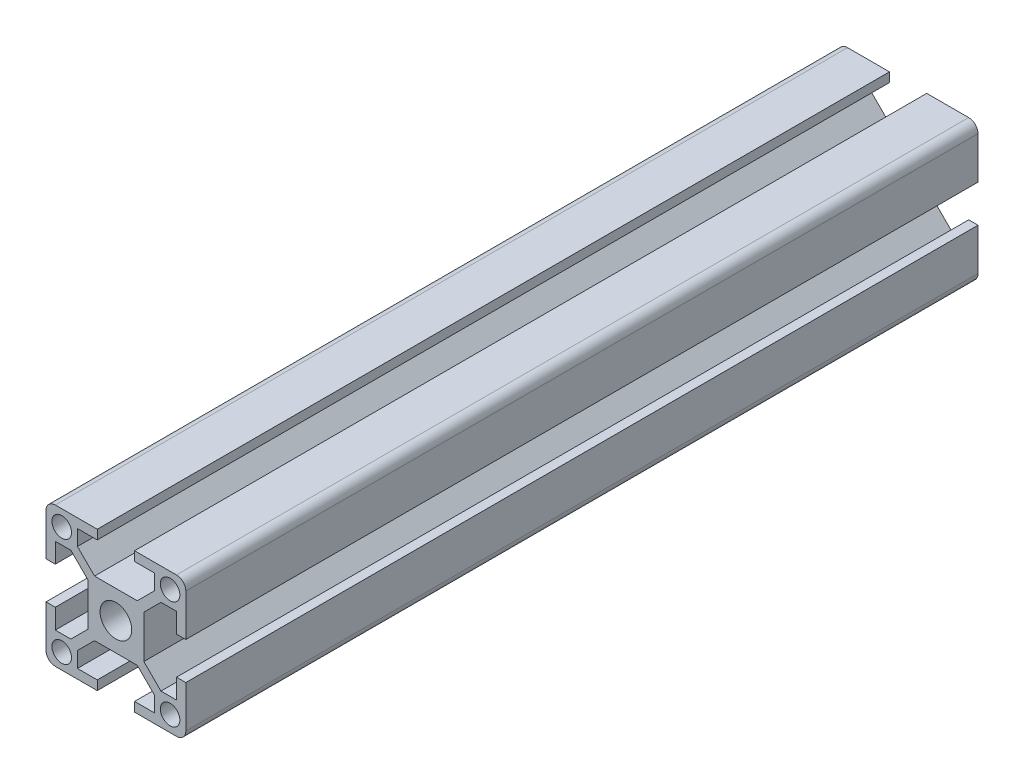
ISO-10303-21;
HEADER;
FILE_DESCRIPTION(('STEP AP214'),'2;1');
FILE_NAME('part.step','',(''),(''),'','','');
FILE_SCHEMA(('AUTOMOTIVE_DESIGN { 1 0 10303 214 1 1 1 1 }'));
ENDSEC;
DATA;
#1=APPLICATION_CONTEXT('core data for automotive mechanical design processes');
#2=APPLICATION_PROTOCOL_DEFINITION('international standard','automotive_design',2000,#1);
#3=PRODUCT_CONTEXT('',#1,'mechanical');
#4=PRODUCT('Part','Part','',(#3));
#5=PRODUCT_RELATED_PRODUCT_CATEGORY('part','',(#4));
#6=PRODUCT_DEFINITION_FORMATION('','',#4);
#7=PRODUCT_DEFINITION_CONTEXT('part definition',#1,'design');
#8=PRODUCT_DEFINITION('design','',#6,#7);
#9=PRODUCT_DEFINITION_SHAPE('','',#8);
#10=(LENGTH_UNIT() NAMED_UNIT(*) SI_UNIT(.MILLI.,.METRE.));
#11=(NAMED_UNIT(*) PLANE_ANGLE_UNIT() SI_UNIT($,.RADIAN.));
#12=(NAMED_UNIT(*) SI_UNIT($,.STERADIAN.) SOLID_ANGLE_UNIT());
#13=UNCERTAINTY_MEASURE_WITH_UNIT(LENGTH_MEASURE(1.E-05),#10,'distance_accuracy_value','');
#14=(GEOMETRIC_REPRESENTATION_CONTEXT(3) GLOBAL_UNCERTAINTY_ASSIGNED_CONTEXT((#13)) GLOBAL_UNIT_ASSIGNED_CONTEXT((#10,
#11,#12)) REPRESENTATION_CONTEXT('',''));
#15=CARTESIAN_POINT('',(0.,0.,0.));
#16=DIRECTION('',(0.,0.,1.));
#17=DIRECTION('',(1.,0.,0.));
#18=AXIS2_PLACEMENT_3D('',#15,#16,#17);
#19=CARTESIAN_POINT('',(13.,-13.,170.));
#20=DIRECTION('',(0.,0.,1.));
#21=DIRECTION('',(1.,0.,0.));
#22=AXIS2_PLACEMENT_3D('',#19,#20,#21);
#23=PLANE('',#22);
#24=CARTESIAN_POINT('',(-11.625,-11.625,170.));
#25=DIRECTION('',(0.,0.,1.));
#26=DIRECTION('',(-1.,0.,0.));
#27=AXIS2_PLACEMENT_3D('',#24,#25,#26);
#28=CIRCLE('',#27,2.1);
#29=CARTESIAN_POINT('',(-13.725,-11.625,170.));
#30=VERTEX_POINT('',#29);
#31=EDGE_CURVE('E762',#30,#30,#28,.T.);
#32=ORIENTED_EDGE('',*,*,#31,.F.);
#33=EDGE_LOOP('',(#32));
#34=FACE_BOUND('',#33,.T.);
#35=CARTESIAN_POINT('',(-11.625,11.625,170.));
#36=DIRECTION('',(0.,0.,1.));
#37=DIRECTION('',(1.,0.,0.));
#38=AXIS2_PLACEMENT_3D('',#35,#36,#37);
#39=CIRCLE('',#38,2.1);
#40=CARTESIAN_POINT('',(-9.52500000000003,11.625,170.));
#41=VERTEX_POINT('',#40);
#42=EDGE_CURVE('E774',#41,#41,#39,.T.);
#43=ORIENTED_EDGE('',*,*,#42,.F.);
#44=EDGE_LOOP('',(#43));
#45=FACE_BOUND('',#44,.T.);
#46=DIRECTION('',(-1.,0.,0.));
#47=VECTOR('',#46,1.);
#48=CARTESIAN_POINT('',(9.66421356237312,-8.25000000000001,170.));
#49=LINE('',#48,#47);
#50=CARTESIAN_POINT('',(13.,-8.25000000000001,170.));
#51=VERTEX_POINT('',#50);
#52=CARTESIAN_POINT('',(9.66421356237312,-8.25000000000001,170.));
#53=VERTEX_POINT('',#52);
#54=EDGE_CURVE('E463',#51,#53,#49,.T.);
#55=ORIENTED_EDGE('',*,*,#54,.T.);
#56=DIRECTION('',(-0.707106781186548,0.707106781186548,0.));
#57=VECTOR('',#56,1.);
#58=CARTESIAN_POINT('',(6.00000000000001,-4.58578643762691,170.));
#59=LINE('',#58,#57);
#60=CARTESIAN_POINT('',(6.00000000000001,-4.58578643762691,170.));
#61=VERTEX_POINT('',#60);
#62=EDGE_CURVE('E211',#53,#61,#59,.T.);
#63=ORIENTED_EDGE('',*,*,#62,.T.);
#64=DIRECTION('',(0.,1.,0.));
#65=VECTOR('',#64,1.);
#66=CARTESIAN_POINT('',(6.00000000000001,4.58578643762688,170.));
#67=LINE('',#66,#65);
#68=CARTESIAN_POINT('',(6.00000000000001,4.58578643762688,170.));
#69=VERTEX_POINT('',#68);
#70=EDGE_CURVE('E598',#61,#69,#67,.T.);
#71=ORIENTED_EDGE('',*,*,#70,.T.);
#72=DIRECTION('',(0.707106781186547,0.707106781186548,0.));
#73=VECTOR('',#72,1.);
#74=CARTESIAN_POINT('',(6.00000000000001,4.58578643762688,170.));
#75=LINE('',#74,#73);
#76=CARTESIAN_POINT('',(9.66421356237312,8.24999999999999,170.));
#77=VERTEX_POINT('',#76);
#78=EDGE_CURVE('E617',#69,#77,#75,.T.);
#79=ORIENTED_EDGE('',*,*,#78,.T.);
#80=DIRECTION('',(1.,0.,0.));
#81=VECTOR('',#80,1.);
#82=CARTESIAN_POINT('',(9.66421356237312,8.24999999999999,170.));
#83=LINE('',#82,#81);
#84=CARTESIAN_POINT('',(13.,8.24999999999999,170.));
#85=VERTEX_POINT('',#84);
#86=EDGE_CURVE('E614',#77,#85,#83,.T.);
#87=ORIENTED_EDGE('',*,*,#86,.T.);
#88=DIRECTION('',(0.,-1.,0.));
#89=VECTOR('',#88,1.);
#90=CARTESIAN_POINT('',(13.,8.24999999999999,170.));
#91=LINE('',#90,#89);
#92=CARTESIAN_POINT('',(13.,3.99999999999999,170.));
#93=VERTEX_POINT('',#92);
#94=EDGE_CURVE('E616',#85,#93,#91,.T.);
#95=ORIENTED_EDGE('',*,*,#94,.T.);
#96=DIRECTION('',(1.,0.,0.));
#97=VECTOR('',#96,1.);
#98=CARTESIAN_POINT('',(13.,3.99999999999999,170.));
#99=LINE('',#98,#97);
#100=CARTESIAN_POINT('',(15.,3.99999999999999,170.));
#101=VERTEX_POINT('',#100);
#102=EDGE_CURVE('E619',#93,#101,#99,.T.);
#103=ORIENTED_EDGE('',*,*,#102,.T.);
#104=DIRECTION('',(0.,1.,0.));
#105=VECTOR('',#104,1.);
#106=CARTESIAN_POINT('',(15.,13.,170.));
#107=LINE('',#106,#105);
#108=CARTESIAN_POINT('',(15.,13.,170.));
#109=VERTEX_POINT('',#108);
#110=EDGE_CURVE('E625',#101,#109,#107,.T.);
#111=ORIENTED_EDGE('',*,*,#110,.T.);
#112=CARTESIAN_POINT('',(13.,13.,170.));
#113=DIRECTION('',(0.,0.,1.));
#114=DIRECTION('',(-1.,0.,0.));
#115=AXIS2_PLACEMENT_3D('',#112,#113,#114);
#116=CIRCLE('',#115,2.);
#117=CARTESIAN_POINT('',(13.,15.,170.));
#118=VERTEX_POINT('',#117);
#119=EDGE_CURVE('E627',#109,#118,#116,.T.);
#120=ORIENTED_EDGE('',*,*,#119,.T.);
#121=DIRECTION('',(-1.,0.,0.));
#122=VECTOR('',#121,1.);
#123=CARTESIAN_POINT('',(3.99999999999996,15.,170.));
#124=LINE('',#123,#122);
#125=CARTESIAN_POINT('',(3.99999999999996,15.,170.));
#126=VERTEX_POINT('',#125);
#127=EDGE_CURVE('E629',#118,#126,#124,.T.);
#128=ORIENTED_EDGE('',*,*,#127,.T.);
#129=DIRECTION('',(0.,-1.,0.));
#130=VECTOR('',#129,1.);
#131=CARTESIAN_POINT('',(3.99999999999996,13.,170.));
#132=LINE('',#131,#130);
#133=CARTESIAN_POINT('',(3.99999999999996,13.,170.));
#134=VERTEX_POINT('',#133);
#135=EDGE_CURVE('E631',#126,#134,#132,.T.);
#136=ORIENTED_EDGE('',*,*,#135,.T.);
#137=DIRECTION('',(1.,0.,0.));
#138=VECTOR('',#137,1.);
#139=CARTESIAN_POINT('',(3.99999999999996,13.,170.));
#140=LINE('',#139,#138);
#141=CARTESIAN_POINT('',(8.24999999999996,13.,170.));
#142=VERTEX_POINT('',#141);
#143=EDGE_CURVE('E633',#134,#142,#140,.T.);
#144=ORIENTED_EDGE('',*,*,#143,.T.);
#145=DIRECTION('',(0.,-1.,0.));
#146=VECTOR('',#145,1.);
#147=CARTESIAN_POINT('',(8.24999999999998,9.66421356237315,170.));
#148=LINE('',#147,#146);
#149=CARTESIAN_POINT('',(8.24999999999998,9.66421356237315,170.));
#150=VERTEX_POINT('',#149);
#151=EDGE_CURVE('E635',#142,#150,#148,.T.);
#152=ORIENTED_EDGE('',*,*,#151,.T.);
#153=DIRECTION('',(-0.707106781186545,-0.70710678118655,0.));
#154=VECTOR('',#153,1.);
#155=CARTESIAN_POINT('',(4.58578643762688,6.00000000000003,170.));
#156=LINE('',#155,#154);
#157=CARTESIAN_POINT('',(4.58578643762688,6.00000000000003,170.));
#158=VERTEX_POINT('',#157);
#159=EDGE_CURVE('E637',#150,#158,#156,.T.);
#160=ORIENTED_EDGE('',*,*,#159,.T.);
#161=DIRECTION('',(-1.,0.,0.));
#162=VECTOR('',#161,1.);
#163=CARTESIAN_POINT('',(-4.5857864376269,5.99999999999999,170.));
#164=LINE('',#163,#162);
#165=CARTESIAN_POINT('',(-4.5857864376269,5.99999999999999,170.));
#166=VERTEX_POINT('',#165);
#167=EDGE_CURVE('E639',#158,#166,#164,.T.);
#168=ORIENTED_EDGE('',*,*,#167,.T.);
#169=DIRECTION('',(-0.70710678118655,0.707106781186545,0.));
#170=VECTOR('',#169,1.);
#171=CARTESIAN_POINT('',(-4.5857864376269,5.99999999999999,170.));
#172=LINE('',#171,#170);
#173=CARTESIAN_POINT('',(-8.25000000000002,9.66421356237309,170.));
#174=VERTEX_POINT('',#173);
#175=EDGE_CURVE('E641',#166,#174,#172,.T.);
#176=ORIENTED_EDGE('',*,*,#175,.T.);
#177=DIRECTION('',(0.,1.,0.));
#178=VECTOR('',#177,1.);
#179=CARTESIAN_POINT('',(-8.25000000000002,9.66421356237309,170.));
#180=LINE('',#179,#178);
#181=CARTESIAN_POINT('',(-8.25000000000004,13.,170.));
#182=VERTEX_POINT('',#181);
#183=EDGE_CURVE('E643',#174,#182,#180,.T.);
#184=ORIENTED_EDGE('',*,*,#183,.T.);
#185=DIRECTION('',(1.,0.,0.));
#186=VECTOR('',#185,1.);
#187=CARTESIAN_POINT('',(-8.25000000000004,13.,170.));
#188=LINE('',#187,#186);
#189=CARTESIAN_POINT('',(-4.00000000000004,13.,170.));
#190=VERTEX_POINT('',#189);
#191=EDGE_CURVE('E645',#182,#190,#188,.T.);
#192=ORIENTED_EDGE('',*,*,#191,.T.);
#193=DIRECTION('',(0.,1.,0.));
#194=VECTOR('',#193,1.);
#195=CARTESIAN_POINT('',(-4.00000000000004,13.,170.));
#196=LINE('',#195,#194);
#197=CARTESIAN_POINT('',(-4.00000000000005,15.,170.));
#198=VERTEX_POINT('',#197);
#199=EDGE_CURVE('E647',#190,#198,#196,.T.);
#200=ORIENTED_EDGE('',*,*,#199,.T.);
#201=DIRECTION('',(-1.,0.,0.));
#202=VECTOR('',#201,1.);
#203=CARTESIAN_POINT('',(-13.,15.,170.));
#204=LINE('',#203,#202);
#205=CARTESIAN_POINT('',(-13.,15.,170.));
#206=VERTEX_POINT('',#205);
#207=EDGE_CURVE('E649',#198,#206,#204,.T.);
#208=ORIENTED_EDGE('',*,*,#207,.T.);
#209=CARTESIAN_POINT('',(-13.,13.,170.));
#210=DIRECTION('',(0.,0.,1.));
#211=DIRECTION('',(1.,0.,0.));
#212=AXIS2_PLACEMENT_3D('',#209,#210,#211);
#213=CIRCLE('',#212,2.);
#214=CARTESIAN_POINT('',(-15.,13.,170.));
#215=VERTEX_POINT('',#214);
#216=EDGE_CURVE('E651',#206,#215,#213,.T.);
#217=ORIENTED_EDGE('',*,*,#216,.T.);
#218=DIRECTION('',(0.,-1.,0.));
#219=VECTOR('',#218,1.);
#220=CARTESIAN_POINT('',(-15.,13.,170.));
#221=LINE('',#220,#219);
#222=CARTESIAN_POINT('',(-15.,3.9999999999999,170.));
#223=VERTEX_POINT('',#222);
#224=EDGE_CURVE('E653',#215,#223,#221,.T.);
#225=ORIENTED_EDGE('',*,*,#224,.T.);
#226=DIRECTION('',(1.,0.,0.));
#227=VECTOR('',#226,1.);
#228=CARTESIAN_POINT('',(-13.,3.99999999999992,170.));
#229=LINE('',#228,#227);
#230=CARTESIAN_POINT('',(-13.,3.99999999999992,170.));
#231=VERTEX_POINT('',#230);
#232=EDGE_CURVE('E655',#223,#231,#229,.T.);
#233=ORIENTED_EDGE('',*,*,#232,.T.);
#234=DIRECTION('',(0.,1.,0.));
#235=VECTOR('',#234,1.);
#236=CARTESIAN_POINT('',(-13.,3.99999999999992,170.));
#237=LINE('',#236,#235);
#238=CARTESIAN_POINT('',(-13.0000000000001,8.24999999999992,170.));
#239=VERTEX_POINT('',#238);
#240=EDGE_CURVE('E657',#231,#239,#237,.T.);
#241=ORIENTED_EDGE('',*,*,#240,.T.);
#242=DIRECTION('',(1.,0.,0.));
#243=VECTOR('',#242,1.);
#244=CARTESIAN_POINT('',(-9.66421356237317,8.24999999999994,170.));
#245=LINE('',#244,#243);
#246=CARTESIAN_POINT('',(-9.66421356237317,8.24999999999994,170.));
#247=VERTEX_POINT('',#246);
#248=EDGE_CURVE('E659',#239,#247,#245,.T.);
#249=ORIENTED_EDGE('',*,*,#248,.T.);
#250=DIRECTION('',(0.707106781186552,-0.707106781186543,0.));
#251=VECTOR('',#250,1.);
#252=CARTESIAN_POINT('',(-6.00000000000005,4.58578643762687,170.));
#253=LINE('',#252,#251);
#254=CARTESIAN_POINT('',(-6.00000000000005,4.58578643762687,170.));
#255=VERTEX_POINT('',#254);
#256=EDGE_CURVE('E661',#247,#255,#253,.T.);
#257=ORIENTED_EDGE('',*,*,#256,.T.);
#258=DIRECTION('',(0.,-1.,0.));
#259=VECTOR('',#258,1.);
#260=CARTESIAN_POINT('',(-5.99999999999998,-4.58578643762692,170.));
#261=LINE('',#260,#259);
#262=CARTESIAN_POINT('',(-5.99999999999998,-4.58578643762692,170.));
#263=VERTEX_POINT('',#262);
#264=EDGE_CURVE('E663',#255,#263,#261,.T.);
#265=ORIENTED_EDGE('',*,*,#264,.T.);
#266=DIRECTION('',(-0.707106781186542,-0.707106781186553,0.));
#267=VECTOR('',#266,1.);
#268=CARTESIAN_POINT('',(-5.99999999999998,-4.58578643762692,170.));
#269=LINE('',#268,#267);
#270=CARTESIAN_POINT('',(-9.66421356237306,-8.25000000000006,170.));
#271=VERTEX_POINT('',#270);
#272=EDGE_CURVE('E665',#263,#271,#269,.T.);
#273=ORIENTED_EDGE('',*,*,#272,.T.);
#274=DIRECTION('',(-1.,0.,0.));
#275=VECTOR('',#274,1.);
#276=CARTESIAN_POINT('',(-9.66421356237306,-8.25000000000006,170.));
#277=LINE('',#276,#275);
#278=CARTESIAN_POINT('',(-13.,-8.25000000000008,170.));
#279=VERTEX_POINT('',#278);
#280=EDGE_CURVE('E667',#271,#279,#277,.T.);
#281=ORIENTED_EDGE('',*,*,#280,.T.);
#282=DIRECTION('',(0.,1.,0.));
#283=VECTOR('',#282,1.);
#284=CARTESIAN_POINT('',(-13.,-8.25000000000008,170.));
#285=LINE('',#284,#283);
#286=CARTESIAN_POINT('',(-13.,-4.00000000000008,170.));
#287=VERTEX_POINT('',#286);
#288=EDGE_CURVE('E669',#279,#287,#285,.T.);
#289=ORIENTED_EDGE('',*,*,#288,.T.);
#290=DIRECTION('',(-1.,0.,0.));
#291=VECTOR('',#290,1.);
#292=CARTESIAN_POINT('',(-13.,-4.00000000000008,170.));
#293=LINE('',#292,#291);
#294=CARTESIAN_POINT('',(-15.,-4.0000000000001,170.));
#295=VERTEX_POINT('',#294);
#296=EDGE_CURVE('E671',#287,#295,#293,.T.);
#297=ORIENTED_EDGE('',*,*,#296,.T.);
#298=DIRECTION('',(0.,-1.,0.));
#299=VECTOR('',#298,1.);
#300=CARTESIAN_POINT('',(-15.,-4.0000000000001,170.));
#301=LINE('',#300,#299);
#302=CARTESIAN_POINT('',(-15.,-13.,170.));
#303=VERTEX_POINT('',#302);
#304=EDGE_CURVE('E673',#295,#303,#301,.T.);
#305=ORIENTED_EDGE('',*,*,#304,.T.);
#306=CARTESIAN_POINT('',(-13.,-13.,170.));
#307=DIRECTION('',(0.,0.,1.));
#308=DIRECTION('',(1.,0.,0.));
#309=AXIS2_PLACEMENT_3D('',#306,#307,#308);
#310=CIRCLE('',#309,2.);
#311=CARTESIAN_POINT('',(-13.,-15.,170.));
#312=VERTEX_POINT('',#311);
#313=EDGE_CURVE('E675',#303,#312,#310,.T.);
#314=ORIENTED_EDGE('',*,*,#313,.T.);
#315=DIRECTION('',(1.,0.,0.));
#316=VECTOR('',#315,1.);
#317=CARTESIAN_POINT('',(-13.,-15.,170.));
#318=LINE('',#317,#316);
#319=CARTESIAN_POINT('',(-4.00000000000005,-15.,170.));
#320=VERTEX_POINT('',#319);
#321=EDGE_CURVE('E677',#312,#320,#318,.T.);
#322=ORIENTED_EDGE('',*,*,#321,.T.);
#323=DIRECTION('',(0.,1.,0.));
#324=VECTOR('',#323,1.);
#325=CARTESIAN_POINT('',(-4.00000000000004,-13.,170.));
#326=LINE('',#325,#324);
#327=CARTESIAN_POINT('',(-4.00000000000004,-13.,170.));
#328=VERTEX_POINT('',#327);
#329=EDGE_CURVE('E679',#320,#328,#326,.T.);
#330=ORIENTED_EDGE('',*,*,#329,.T.);
#331=DIRECTION('',(-1.,0.,0.));
#332=VECTOR('',#331,1.);
#333=CARTESIAN_POINT('',(-8.25000000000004,-13.,170.));
#334=LINE('',#333,#332);
#335=CARTESIAN_POINT('',(-8.25000000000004,-13.,170.));
#336=VERTEX_POINT('',#335);
#337=EDGE_CURVE('E681',#328,#336,#334,.T.);
#338=ORIENTED_EDGE('',*,*,#337,.T.);
#339=DIRECTION('',(0.,1.,0.));
#340=VECTOR('',#339,1.);
#341=CARTESIAN_POINT('',(-8.25000000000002,-9.6642135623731,170.));
#342=LINE('',#341,#340);
#343=CARTESIAN_POINT('',(-8.25000000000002,-9.6642135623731,170.));
#344=VERTEX_POINT('',#343);
#345=EDGE_CURVE('E683',#336,#344,#342,.T.);
#346=ORIENTED_EDGE('',*,*,#345,.T.);
#347=DIRECTION('',(0.707106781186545,0.70710678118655,0.));
#348=VECTOR('',#347,1.);
#349=CARTESIAN_POINT('',(-4.58578643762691,-5.99999999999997,170.));
#350=LINE('',#349,#348);
#351=CARTESIAN_POINT('',(-4.58578643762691,-5.99999999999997,170.));
#352=VERTEX_POINT('',#351);
#353=EDGE_CURVE('E685',#344,#352,#350,.T.);
#354=ORIENTED_EDGE('',*,*,#353,.T.);
#355=DIRECTION('',(1.,0.,0.));
#356=VECTOR('',#355,1.);
#357=CARTESIAN_POINT('',(-4.58578643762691,-5.99999999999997,170.));
#358=LINE('',#357,#356);
#359=CARTESIAN_POINT('',(4.58578643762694,-5.99999999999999,170.));
#360=VERTEX_POINT('',#359);
#361=EDGE_CURVE('E687',#352,#360,#358,.T.);
#362=ORIENTED_EDGE('',*,*,#361,.T.);
#363=DIRECTION('',(0.707106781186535,-0.70710678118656,0.));
#364=VECTOR('',#363,1.);
#365=CARTESIAN_POINT('',(4.58578643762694,-5.99999999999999,170.));
#366=LINE('',#365,#364);
#367=CARTESIAN_POINT('',(8.24999999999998,-9.66421356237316,170.));
#368=VERTEX_POINT('',#367);
#369=EDGE_CURVE('E689',#360,#368,#366,.T.);
#370=ORIENTED_EDGE('',*,*,#369,.T.);
#371=DIRECTION('',(0.,-1.,0.));
#372=VECTOR('',#371,1.);
#373=CARTESIAN_POINT('',(8.24999999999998,-9.66421356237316,170.));
#374=LINE('',#373,#372);
#375=CARTESIAN_POINT('',(8.24999999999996,-13.0000000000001,170.));
#376=VERTEX_POINT('',#375);
#377=EDGE_CURVE('E691',#368,#376,#374,.T.);
#378=ORIENTED_EDGE('',*,*,#377,.T.);
#379=DIRECTION('',(-1.,0.,0.));
#380=VECTOR('',#379,1.);
#381=CARTESIAN_POINT('',(3.99999999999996,-13.,170.));
#382=LINE('',#381,#380);
#383=CARTESIAN_POINT('',(3.99999999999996,-13.,170.));
#384=VERTEX_POINT('',#383);
#385=EDGE_CURVE('E693',#376,#384,#382,.T.);
#386=ORIENTED_EDGE('',*,*,#385,.T.);
#387=DIRECTION('',(0.,-1.,0.));
#388=VECTOR('',#387,1.);
#389=CARTESIAN_POINT('',(3.99999999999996,-13.,170.));
#390=LINE('',#389,#388);
#391=CARTESIAN_POINT('',(3.99999999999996,-15.,170.));
#392=VERTEX_POINT('',#391);
#393=EDGE_CURVE('E695',#384,#392,#390,.T.);
#394=ORIENTED_EDGE('',*,*,#393,.T.);
#395=DIRECTION('',(1.,0.,0.));
#396=VECTOR('',#395,1.);
#397=CARTESIAN_POINT('',(3.99999999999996,-15.,170.));
#398=LINE('',#397,#396);
#399=CARTESIAN_POINT('',(13.,-15.,170.));
#400=VERTEX_POINT('',#399);
#401=EDGE_CURVE('E697',#392,#400,#398,.T.);
#402=ORIENTED_EDGE('',*,*,#401,.T.);
#403=CARTESIAN_POINT('',(13.,-13.,170.));
#404=DIRECTION('',(0.,0.,1.));
#405=DIRECTION('',(1.,0.,0.));
#406=AXIS2_PLACEMENT_3D('',#403,#404,#405);
#407=CIRCLE('',#406,2.);
#408=CARTESIAN_POINT('',(15.,-13.,170.));
#409=VERTEX_POINT('',#408);
#410=EDGE_CURVE('E350',#400,#409,#407,.T.);
#411=ORIENTED_EDGE('',*,*,#410,.T.);
#412=DIRECTION('',(0.,1.,0.));
#413=VECTOR('',#412,1.);
#414=CARTESIAN_POINT('',(15.,-4.00000000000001,170.));
#415=LINE('',#414,#413);
#416=CARTESIAN_POINT('',(15.,-4.00000000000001,170.));
#417=VERTEX_POINT('',#416);
#418=EDGE_CURVE('E344',#409,#417,#415,.T.);
#419=ORIENTED_EDGE('',*,*,#418,.T.);
#420=DIRECTION('',(-1.,0.,0.));
#421=VECTOR('',#420,1.);
#422=CARTESIAN_POINT('',(13.,-4.00000000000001,170.));
#423=LINE('',#422,#421);
#424=CARTESIAN_POINT('',(13.,-4.00000000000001,170.));
#425=VERTEX_POINT('',#424);
#426=EDGE_CURVE('E348',#417,#425,#423,.T.);
#427=ORIENTED_EDGE('',*,*,#426,.T.);
#428=DIRECTION('',(0.,-1.,0.));
#429=VECTOR('',#428,1.);
#430=CARTESIAN_POINT('',(13.,-4.00000000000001,170.));
#431=LINE('',#430,#429);
#432=EDGE_CURVE('E48',#425,#51,#431,.T.);
#433=ORIENTED_EDGE('',*,*,#432,.T.);
#434=EDGE_LOOP('',(#55,#63,#71,#79,#87,#95,#103,#111,#120,#128,#136,#144,#152,#160,#168,#176,
#184,#192,#200,#208,#217,#225,#233,#241,#249,#257,#265,#273,#281,#289,#297,#305,#314,#322,#330,
#338,#346,#354,#362,#370,#378,#386,#394,#402,#411,#419,#427,#433));
#435=FACE_BOUND('',#434,.T.);
#436=CARTESIAN_POINT('',(11.625,11.625,170.));
#437=DIRECTION('',(0.,0.,1.));
#438=DIRECTION('',(1.,0.,0.));
#439=AXIS2_PLACEMENT_3D('',#436,#437,#438);
#440=CIRCLE('',#439,2.1);
#441=CARTESIAN_POINT('',(13.725,11.625,170.));
#442=VERTEX_POINT('',#441);
#443=EDGE_CURVE('E372',#442,#442,#440,.T.);
#444=ORIENTED_EDGE('',*,*,#443,.F.);
#445=EDGE_LOOP('',(#444));
#446=FACE_BOUND('',#445,.T.);
#447=CARTESIAN_POINT('',(0.,0.,170.));
#448=DIRECTION('',(0.,0.,1.));
#449=DIRECTION('',(1.,0.,0.));
#450=AXIS2_PLACEMENT_3D('',#447,#448,#449);
#451=CIRCLE('',#450,3.4);
#452=CARTESIAN_POINT('',(3.40000000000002,0.,170.));
#453=VERTEX_POINT('',#452);
#454=EDGE_CURVE('E768',#453,#453,#451,.T.);
#455=ORIENTED_EDGE('',*,*,#454,.F.);
#456=EDGE_LOOP('',(#455));
#457=FACE_BOUND('',#456,.T.);
#458=CARTESIAN_POINT('',(11.625,-11.625,170.));
#459=DIRECTION('',(0.,0.,1.));
#460=DIRECTION('',(-1.,0.,0.));
#461=AXIS2_PLACEMENT_3D('',#458,#459,#460);
#462=CIRCLE('',#461,2.1);
#463=CARTESIAN_POINT('',(9.52500000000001,-11.625,170.));
#464=VERTEX_POINT('',#463);
#465=EDGE_CURVE('E753',#464,#464,#462,.T.);
#466=ORIENTED_EDGE('',*,*,#465,.F.);
#467=EDGE_LOOP('',(#466));
#468=FACE_BOUND('',#467,.T.);
#469=ADVANCED_FACE('F31',(#34,#45,#435,#446,#457,#468),#23,.T.);
#470=CARTESIAN_POINT('',(13.,-13.,0.));
#471=DIRECTION('',(0.,0.,1.));
#472=DIRECTION('',(1.,0.,0.));
#473=AXIS2_PLACEMENT_3D('',#470,#471,#472);
#474=PLANE('',#473);
#475=CARTESIAN_POINT('',(-11.625,-11.625,0.));
#476=DIRECTION('',(0.,0.,1.));
#477=DIRECTION('',(-1.,0.,0.));
#478=AXIS2_PLACEMENT_3D('',#475,#476,#477);
#479=CIRCLE('',#478,2.1);
#480=CARTESIAN_POINT('',(-13.725,-11.625,0.));
#481=VERTEX_POINT('',#480);
#482=EDGE_CURVE('E759',#481,#481,#479,.T.);
#483=ORIENTED_EDGE('',*,*,#482,.T.);
#484=EDGE_LOOP('',(#483));
#485=FACE_BOUND('',#484,.T.);
#486=CARTESIAN_POINT('',(-11.625,11.625,0.));
#487=DIRECTION('',(0.,0.,1.));
#488=DIRECTION('',(1.,0.,0.));
#489=AXIS2_PLACEMENT_3D('',#486,#487,#488);
#490=CIRCLE('',#489,2.1);
#491=CARTESIAN_POINT('',(-9.52500000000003,11.625,0.));
#492=VERTEX_POINT('',#491);
#493=EDGE_CURVE('E771',#492,#492,#490,.T.);
#494=ORIENTED_EDGE('',*,*,#493,.T.);
#495=EDGE_LOOP('',(#494));
#496=FACE_BOUND('',#495,.T.);
#497=DIRECTION('',(-1.,0.,0.));
#498=VECTOR('',#497,1.);
#499=CARTESIAN_POINT('',(9.66421356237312,-8.25000000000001,0.));
#500=LINE('',#499,#498);
#501=CARTESIAN_POINT('',(13.,-8.25000000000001,0.));
#502=VERTEX_POINT('',#501);
#503=CARTESIAN_POINT('',(9.66421356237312,-8.25000000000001,0.));
#504=VERTEX_POINT('',#503);
#505=EDGE_CURVE('E368',#502,#504,#500,.T.);
#506=ORIENTED_EDGE('',*,*,#505,.F.);
#507=DIRECTION('',(0.,-1.,0.));
#508=VECTOR('',#507,1.);
#509=CARTESIAN_POINT('',(13.,-4.00000000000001,0.));
#510=LINE('',#509,#508);
#511=CARTESIAN_POINT('',(13.,-4.00000000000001,0.));
#512=VERTEX_POINT('',#511);
#513=EDGE_CURVE('E203',#512,#502,#510,.T.);
#514=ORIENTED_EDGE('',*,*,#513,.F.);
#515=DIRECTION('',(-1.,0.,0.));
#516=VECTOR('',#515,1.);
#517=CARTESIAN_POINT('',(13.,-4.00000000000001,0.));
#518=LINE('',#517,#516);
#519=CARTESIAN_POINT('',(15.,-4.00000000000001,0.));
#520=VERTEX_POINT('',#519);
#521=EDGE_CURVE('E197',#520,#512,#518,.T.);
#522=ORIENTED_EDGE('',*,*,#521,.F.);
#523=DIRECTION('',(0.,1.,0.));
#524=VECTOR('',#523,1.);
#525=CARTESIAN_POINT('',(15.,-4.00000000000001,0.));
#526=LINE('',#525,#524);
#527=CARTESIAN_POINT('',(15.,-13.,0.));
#528=VERTEX_POINT('',#527);
#529=EDGE_CURVE('E358',#528,#520,#526,.T.);
#530=ORIENTED_EDGE('',*,*,#529,.F.);
#531=CARTESIAN_POINT('',(13.,-13.,0.));
#532=DIRECTION('',(0.,0.,1.));
#533=DIRECTION('',(1.,0.,0.));
#534=AXIS2_PLACEMENT_3D('',#531,#532,#533);
#535=CIRCLE('',#534,2.);
#536=CARTESIAN_POINT('',(13.,-15.,0.));
#537=VERTEX_POINT('',#536);
#538=EDGE_CURVE('E458',#537,#528,#535,.T.);
#539=ORIENTED_EDGE('',*,*,#538,.F.);
#540=DIRECTION('',(1.,0.,0.));
#541=VECTOR('',#540,1.);
#542=CARTESIAN_POINT('',(3.99999999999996,-15.,0.));
#543=LINE('',#542,#541);
#544=CARTESIAN_POINT('',(3.99999999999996,-15.,0.));
#545=VERTEX_POINT('',#544);
#546=EDGE_CURVE('E456',#545,#537,#543,.T.);
#547=ORIENTED_EDGE('',*,*,#546,.F.);
#548=DIRECTION('',(0.,-1.,0.));
#549=VECTOR('',#548,1.);
#550=CARTESIAN_POINT('',(3.99999999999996,-13.,0.));
#551=LINE('',#550,#549);
#552=CARTESIAN_POINT('',(3.99999999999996,-13.,0.));
#553=VERTEX_POINT('',#552);
#554=EDGE_CURVE('E454',#553,#545,#551,.T.);
#555=ORIENTED_EDGE('',*,*,#554,.F.);
#556=DIRECTION('',(-1.,0.,0.));
#557=VECTOR('',#556,1.);
#558=CARTESIAN_POINT('',(3.99999999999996,-13.,0.));
#559=LINE('',#558,#557);
#560=CARTESIAN_POINT('',(8.24999999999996,-13.0000000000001,0.));
#561=VERTEX_POINT('',#560);
#562=EDGE_CURVE('E452',#561,#553,#559,.T.);
#563=ORIENTED_EDGE('',*,*,#562,.F.);
#564=DIRECTION('',(0.,-1.,0.));
#565=VECTOR('',#564,1.);
#566=CARTESIAN_POINT('',(8.24999999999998,-9.66421356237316,0.));
#567=LINE('',#566,#565);
#568=CARTESIAN_POINT('',(8.24999999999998,-9.66421356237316,0.));
#569=VERTEX_POINT('',#568);
#570=EDGE_CURVE('E450',#569,#561,#567,.T.);
#571=ORIENTED_EDGE('',*,*,#570,.F.);
#572=DIRECTION('',(0.707106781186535,-0.70710678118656,0.));
#573=VECTOR('',#572,1.);
#574=CARTESIAN_POINT('',(4.58578643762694,-5.99999999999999,0.));
#575=LINE('',#574,#573);
#576=CARTESIAN_POINT('',(4.58578643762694,-5.99999999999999,0.));
#577=VERTEX_POINT('',#576);
#578=EDGE_CURVE('E448',#577,#569,#575,.T.);
#579=ORIENTED_EDGE('',*,*,#578,.F.);
#580=DIRECTION('',(1.,0.,0.));
#581=VECTOR('',#580,1.);
#582=CARTESIAN_POINT('',(-4.58578643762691,-5.99999999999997,0.));
#583=LINE('',#582,#581);
#584=CARTESIAN_POINT('',(-4.58578643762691,-5.99999999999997,0.));
#585=VERTEX_POINT('',#584);
#586=EDGE_CURVE('E446',#585,#577,#583,.T.);
#587=ORIENTED_EDGE('',*,*,#586,.F.);
#588=DIRECTION('',(0.707106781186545,0.70710678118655,0.));
#589=VECTOR('',#588,1.);
#590=CARTESIAN_POINT('',(-4.58578643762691,-5.99999999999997,0.));
#591=LINE('',#590,#589);
#592=CARTESIAN_POINT('',(-8.25000000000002,-9.6642135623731,0.));
#593=VERTEX_POINT('',#592);
#594=EDGE_CURVE('E444',#593,#585,#591,.T.);
#595=ORIENTED_EDGE('',*,*,#594,.F.);
#596=DIRECTION('',(0.,1.,0.));
#597=VECTOR('',#596,1.);
#598=CARTESIAN_POINT('',(-8.25000000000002,-9.6642135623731,0.));
#599=LINE('',#598,#597);
#600=CARTESIAN_POINT('',(-8.25000000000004,-13.,0.));
#601=VERTEX_POINT('',#600);
#602=EDGE_CURVE('E442',#601,#593,#599,.T.);
#603=ORIENTED_EDGE('',*,*,#602,.F.);
#604=DIRECTION('',(-1.,0.,0.));
#605=VECTOR('',#604,1.);
#606=CARTESIAN_POINT('',(-8.25000000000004,-13.,0.));
#607=LINE('',#606,#605);
#608=CARTESIAN_POINT('',(-4.00000000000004,-13.,0.));
#609=VERTEX_POINT('',#608);
#610=EDGE_CURVE('E440',#609,#601,#607,.T.);
#611=ORIENTED_EDGE('',*,*,#610,.F.);
#612=DIRECTION('',(0.,1.,0.));
#613=VECTOR('',#612,1.);
#614=CARTESIAN_POINT('',(-4.00000000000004,-13.,0.));
#615=LINE('',#614,#613);
#616=CARTESIAN_POINT('',(-4.00000000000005,-15.,0.));
#617=VERTEX_POINT('',#616);
#618=EDGE_CURVE('E438',#617,#609,#615,.T.);
#619=ORIENTED_EDGE('',*,*,#618,.F.);
#620=DIRECTION('',(1.,0.,0.));
#621=VECTOR('',#620,1.);
#622=CARTESIAN_POINT('',(-13.,-15.,0.));
#623=LINE('',#622,#621);
#624=CARTESIAN_POINT('',(-13.,-15.,0.));
#625=VERTEX_POINT('',#624);
#626=EDGE_CURVE('E436',#625,#617,#623,.T.);
#627=ORIENTED_EDGE('',*,*,#626,.F.);
#628=CARTESIAN_POINT('',(-13.,-13.,0.));
#629=DIRECTION('',(0.,0.,1.));
#630=DIRECTION('',(1.,0.,0.));
#631=AXIS2_PLACEMENT_3D('',#628,#629,#630);
#632=CIRCLE('',#631,2.);
#633=CARTESIAN_POINT('',(-15.,-13.,0.));
#634=VERTEX_POINT('',#633);
#635=EDGE_CURVE('E434',#634,#625,#632,.T.);
#636=ORIENTED_EDGE('',*,*,#635,.F.);
#637=DIRECTION('',(0.,-1.,0.));
#638=VECTOR('',#637,1.);
#639=CARTESIAN_POINT('',(-15.,-4.0000000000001,0.));
#640=LINE('',#639,#638);
#641=CARTESIAN_POINT('',(-15.,-4.0000000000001,0.));
#642=VERTEX_POINT('',#641);
#643=EDGE_CURVE('E432',#642,#634,#640,.T.);
#644=ORIENTED_EDGE('',*,*,#643,.F.);
#645=DIRECTION('',(-1.,0.,0.));
#646=VECTOR('',#645,1.);
#647=CARTESIAN_POINT('',(-13.,-4.00000000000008,0.));
#648=LINE('',#647,#646);
#649=CARTESIAN_POINT('',(-13.,-4.00000000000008,0.));
#650=VERTEX_POINT('',#649);
#651=EDGE_CURVE('E430',#650,#642,#648,.T.);
#652=ORIENTED_EDGE('',*,*,#651,.F.);
#653=DIRECTION('',(0.,1.,0.));
#654=VECTOR('',#653,1.);
#655=CARTESIAN_POINT('',(-13.,-8.25000000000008,0.));
#656=LINE('',#655,#654);
#657=CARTESIAN_POINT('',(-13.,-8.25000000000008,0.));
#658=VERTEX_POINT('',#657);
#659=EDGE_CURVE('E428',#658,#650,#656,.T.);
#660=ORIENTED_EDGE('',*,*,#659,.F.);
#661=DIRECTION('',(-1.,0.,0.));
#662=VECTOR('',#661,1.);
#663=CARTESIAN_POINT('',(-9.66421356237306,-8.25000000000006,0.));
#664=LINE('',#663,#662);
#665=CARTESIAN_POINT('',(-9.66421356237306,-8.25000000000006,0.));
#666=VERTEX_POINT('',#665);
#667=EDGE_CURVE('E426',#666,#658,#664,.T.);
#668=ORIENTED_EDGE('',*,*,#667,.F.);
#669=DIRECTION('',(-0.707106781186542,-0.707106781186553,0.));
#670=VECTOR('',#669,1.);
#671=CARTESIAN_POINT('',(-5.99999999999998,-4.58578643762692,0.));
#672=LINE('',#671,#670);
#673=CARTESIAN_POINT('',(-5.99999999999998,-4.58578643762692,0.));
#674=VERTEX_POINT('',#673);
#675=EDGE_CURVE('E424',#674,#666,#672,.T.);
#676=ORIENTED_EDGE('',*,*,#675,.F.);
#677=DIRECTION('',(0.,-1.,0.));
#678=VECTOR('',#677,1.);
#679=CARTESIAN_POINT('',(-5.99999999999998,-4.58578643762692,0.));
#680=LINE('',#679,#678);
#681=CARTESIAN_POINT('',(-6.00000000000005,4.58578643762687,0.));
#682=VERTEX_POINT('',#681);
#683=EDGE_CURVE('E422',#682,#674,#680,.T.);
#684=ORIENTED_EDGE('',*,*,#683,.F.);
#685=DIRECTION('',(0.707106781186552,-0.707106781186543,0.));
#686=VECTOR('',#685,1.);
#687=CARTESIAN_POINT('',(-6.00000000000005,4.58578643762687,0.));
#688=LINE('',#687,#686);
#689=CARTESIAN_POINT('',(-9.66421356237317,8.24999999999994,0.));
#690=VERTEX_POINT('',#689);
#691=EDGE_CURVE('E420',#690,#682,#688,.T.);
#692=ORIENTED_EDGE('',*,*,#691,.F.);
#693=DIRECTION('',(1.,0.,0.));
#694=VECTOR('',#693,1.);
#695=CARTESIAN_POINT('',(-9.66421356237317,8.24999999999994,0.));
#696=LINE('',#695,#694);
#697=CARTESIAN_POINT('',(-13.0000000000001,8.24999999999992,0.));
#698=VERTEX_POINT('',#697);
#699=EDGE_CURVE('E418',#698,#690,#696,.T.);
#700=ORIENTED_EDGE('',*,*,#699,.F.);
#701=DIRECTION('',(0.,1.,0.));
#702=VECTOR('',#701,1.);
#703=CARTESIAN_POINT('',(-13.,3.99999999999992,0.));
#704=LINE('',#703,#702);
#705=CARTESIAN_POINT('',(-13.,3.99999999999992,0.));
#706=VERTEX_POINT('',#705);
#707=EDGE_CURVE('E416',#706,#698,#704,.T.);
#708=ORIENTED_EDGE('',*,*,#707,.F.);
#709=DIRECTION('',(1.,0.,0.));
#710=VECTOR('',#709,1.);
#711=CARTESIAN_POINT('',(-13.,3.99999999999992,0.));
#712=LINE('',#711,#710);
#713=CARTESIAN_POINT('',(-15.,3.9999999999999,0.));
#714=VERTEX_POINT('',#713);
#715=EDGE_CURVE('E414',#714,#706,#712,.T.);
#716=ORIENTED_EDGE('',*,*,#715,.F.);
#717=DIRECTION('',(0.,-1.,0.));
#718=VECTOR('',#717,1.);
#719=CARTESIAN_POINT('',(-15.,13.,0.));
#720=LINE('',#719,#718);
#721=CARTESIAN_POINT('',(-15.,13.,0.));
#722=VERTEX_POINT('',#721);
#723=EDGE_CURVE('E412',#722,#714,#720,.T.);
#724=ORIENTED_EDGE('',*,*,#723,.F.);
#725=CARTESIAN_POINT('',(-13.,13.,0.));
#726=DIRECTION('',(0.,0.,1.));
#727=DIRECTION('',(1.,0.,0.));
#728=AXIS2_PLACEMENT_3D('',#725,#726,#727);
#729=CIRCLE('',#728,2.);
#730=CARTESIAN_POINT('',(-13.,15.,0.));
#731=VERTEX_POINT('',#730);
#732=EDGE_CURVE('E410',#731,#722,#729,.T.);
#733=ORIENTED_EDGE('',*,*,#732,.F.);
#734=DIRECTION('',(-1.,0.,0.));
#735=VECTOR('',#734,1.);
#736=CARTESIAN_POINT('',(-13.,15.,0.));
#737=LINE('',#736,#735);
#738=CARTESIAN_POINT('',(-4.00000000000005,15.,0.));
#739=VERTEX_POINT('',#738);
#740=EDGE_CURVE('E408',#739,#731,#737,.T.);
#741=ORIENTED_EDGE('',*,*,#740,.F.);
#742=DIRECTION('',(0.,1.,0.));
#743=VECTOR('',#742,1.);
#744=CARTESIAN_POINT('',(-4.00000000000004,13.,0.));
#745=LINE('',#744,#743);
#746=CARTESIAN_POINT('',(-4.00000000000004,13.,0.));
#747=VERTEX_POINT('',#746);
#748=EDGE_CURVE('E406',#747,#739,#745,.T.);
#749=ORIENTED_EDGE('',*,*,#748,.F.);
#750=DIRECTION('',(1.,0.,0.));
#751=VECTOR('',#750,1.);
#752=CARTESIAN_POINT('',(-8.25000000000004,13.,0.));
#753=LINE('',#752,#751);
#754=CARTESIAN_POINT('',(-8.25000000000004,13.,0.));
#755=VERTEX_POINT('',#754);
#756=EDGE_CURVE('E404',#755,#747,#753,.T.);
#757=ORIENTED_EDGE('',*,*,#756,.F.);
#758=DIRECTION('',(0.,1.,0.));
#759=VECTOR('',#758,1.);
#760=CARTESIAN_POINT('',(-8.25000000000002,9.66421356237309,0.));
#761=LINE('',#760,#759);
#762=CARTESIAN_POINT('',(-8.25000000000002,9.66421356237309,0.));
#763=VERTEX_POINT('',#762);
#764=EDGE_CURVE('E402',#763,#755,#761,.T.);
#765=ORIENTED_EDGE('',*,*,#764,.F.);
#766=DIRECTION('',(-0.70710678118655,0.707106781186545,0.));
#767=VECTOR('',#766,1.);
#768=CARTESIAN_POINT('',(-4.5857864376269,5.99999999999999,0.));
#769=LINE('',#768,#767);
#770=CARTESIAN_POINT('',(-4.5857864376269,5.99999999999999,0.));
#771=VERTEX_POINT('',#770);
#772=EDGE_CURVE('E400',#771,#763,#769,.T.);
#773=ORIENTED_EDGE('',*,*,#772,.F.);
#774=DIRECTION('',(-1.,0.,0.));
#775=VECTOR('',#774,1.);
#776=CARTESIAN_POINT('',(-4.5857864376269,5.99999999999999,0.));
#777=LINE('',#776,#775);
#778=CARTESIAN_POINT('',(4.58578643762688,6.00000000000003,0.));
#779=VERTEX_POINT('',#778);
#780=EDGE_CURVE('E398',#779,#771,#777,.T.);
#781=ORIENTED_EDGE('',*,*,#780,.F.);
#782=DIRECTION('',(-0.707106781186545,-0.70710678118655,0.));
#783=VECTOR('',#782,1.);
#784=CARTESIAN_POINT('',(4.58578643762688,6.00000000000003,0.));
#785=LINE('',#784,#783);
#786=CARTESIAN_POINT('',(8.24999999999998,9.66421356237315,0.));
#787=VERTEX_POINT('',#786);
#788=EDGE_CURVE('E396',#787,#779,#785,.T.);
#789=ORIENTED_EDGE('',*,*,#788,.F.);
#790=DIRECTION('',(0.,-1.,0.));
#791=VECTOR('',#790,1.);
#792=CARTESIAN_POINT('',(8.24999999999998,9.66421356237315,0.));
#793=LINE('',#792,#791);
#794=CARTESIAN_POINT('',(8.24999999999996,13.,0.));
#795=VERTEX_POINT('',#794);
#796=EDGE_CURVE('E394',#795,#787,#793,.T.);
#797=ORIENTED_EDGE('',*,*,#796,.F.);
#798=DIRECTION('',(1.,0.,0.));
#799=VECTOR('',#798,1.);
#800=CARTESIAN_POINT('',(3.99999999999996,13.,0.));
#801=LINE('',#800,#799);
#802=CARTESIAN_POINT('',(3.99999999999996,13.,0.));
#803=VERTEX_POINT('',#802);
#804=EDGE_CURVE('E392',#803,#795,#801,.T.);
#805=ORIENTED_EDGE('',*,*,#804,.F.);
#806=DIRECTION('',(0.,-1.,0.));
#807=VECTOR('',#806,1.);
#808=CARTESIAN_POINT('',(3.99999999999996,13.,0.));
#809=LINE('',#808,#807);
#810=CARTESIAN_POINT('',(3.99999999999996,15.,0.));
#811=VERTEX_POINT('',#810);
#812=EDGE_CURVE('E390',#811,#803,#809,.T.);
#813=ORIENTED_EDGE('',*,*,#812,.F.);
#814=DIRECTION('',(-1.,0.,0.));
#815=VECTOR('',#814,1.);
#816=CARTESIAN_POINT('',(3.99999999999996,15.,0.));
#817=LINE('',#816,#815);
#818=CARTESIAN_POINT('',(13.,15.,0.));
#819=VERTEX_POINT('',#818);
#820=EDGE_CURVE('E388',#819,#811,#817,.T.);
#821=ORIENTED_EDGE('',*,*,#820,.F.);
#822=CARTESIAN_POINT('',(13.,13.,0.));
#823=DIRECTION('',(0.,0.,1.));
#824=DIRECTION('',(-1.,0.,0.));
#825=AXIS2_PLACEMENT_3D('',#822,#823,#824);
#826=CIRCLE('',#825,2.);
#827=CARTESIAN_POINT('',(15.,13.,0.));
#828=VERTEX_POINT('',#827);
#829=EDGE_CURVE('E386',#828,#819,#826,.T.);
#830=ORIENTED_EDGE('',*,*,#829,.F.);
#831=DIRECTION('',(0.,1.,0.));
#832=VECTOR('',#831,1.);
#833=CARTESIAN_POINT('',(15.,13.,0.));
#834=LINE('',#833,#832);
#835=CARTESIAN_POINT('',(15.,3.99999999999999,0.));
#836=VERTEX_POINT('',#835);
#837=EDGE_CURVE('E384',#836,#828,#834,.T.);
#838=ORIENTED_EDGE('',*,*,#837,.F.);
#839=DIRECTION('',(1.,0.,0.));
#840=VECTOR('',#839,1.);
#841=CARTESIAN_POINT('',(13.,3.99999999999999,0.));
#842=LINE('',#841,#840);
#843=CARTESIAN_POINT('',(13.,3.99999999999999,0.));
#844=VERTEX_POINT('',#843);
#845=EDGE_CURVE('E382',#844,#836,#842,.T.);
#846=ORIENTED_EDGE('',*,*,#845,.F.);
#847=DIRECTION('',(0.,-1.,0.));
#848=VECTOR('',#847,1.);
#849=CARTESIAN_POINT('',(13.,8.24999999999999,0.));
#850=LINE('',#849,#848);
#851=CARTESIAN_POINT('',(13.,8.24999999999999,0.));
#852=VERTEX_POINT('',#851);
#853=EDGE_CURVE('E380',#852,#844,#850,.T.);
#854=ORIENTED_EDGE('',*,*,#853,.F.);
#855=DIRECTION('',(1.,0.,0.));
#856=VECTOR('',#855,1.);
#857=CARTESIAN_POINT('',(9.66421356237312,8.24999999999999,0.));
#858=LINE('',#857,#856);
#859=CARTESIAN_POINT('',(9.66421356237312,8.24999999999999,0.));
#860=VERTEX_POINT('',#859);
#861=EDGE_CURVE('E378',#860,#852,#858,.T.);
#862=ORIENTED_EDGE('',*,*,#861,.F.);
#863=DIRECTION('',(0.707106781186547,0.707106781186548,0.));
#864=VECTOR('',#863,1.);
#865=CARTESIAN_POINT('',(6.00000000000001,4.58578643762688,0.));
#866=LINE('',#865,#864);
#867=CARTESIAN_POINT('',(6.00000000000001,4.58578643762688,0.));
#868=VERTEX_POINT('',#867);
#869=EDGE_CURVE('E376',#868,#860,#866,.T.);
#870=ORIENTED_EDGE('',*,*,#869,.F.);
#871=DIRECTION('',(0.,1.,0.));
#872=VECTOR('',#871,1.);
#873=CARTESIAN_POINT('',(6.00000000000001,4.58578643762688,0.));
#874=LINE('',#873,#872);
#875=CARTESIAN_POINT('',(6.00000000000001,-4.58578643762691,0.));
#876=VERTEX_POINT('',#875);
#877=EDGE_CURVE('E374',#876,#868,#874,.T.);
#878=ORIENTED_EDGE('',*,*,#877,.F.);
#879=DIRECTION('',(-0.707106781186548,0.707106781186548,0.));
#880=VECTOR('',#879,1.);
#881=CARTESIAN_POINT('',(6.00000000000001,-4.58578643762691,0.));
#882=LINE('',#881,#880);
#883=EDGE_CURVE('E371',#504,#876,#882,.T.);
#884=ORIENTED_EDGE('',*,*,#883,.F.);
#885=EDGE_LOOP('',(#506,#514,#522,#530,#539,#547,#555,#563,#571,#579,#587,#595,#603,#611,#619,
#627,#636,#644,#652,#660,#668,#676,#684,#692,#700,#708,#716,#724,#733,#741,#749,#757,#765,#773,
#781,#789,#797,#805,#813,#821,#830,#838,#846,#854,#862,#870,#878,#884));
#886=FACE_BOUND('',#885,.T.);
#887=CARTESIAN_POINT('',(11.625,11.625,0.));
#888=DIRECTION('',(0.,0.,1.));
#889=DIRECTION('',(1.,0.,0.));
#890=AXIS2_PLACEMENT_3D('',#887,#888,#889);
#891=CIRCLE('',#890,2.1);
#892=CARTESIAN_POINT('',(13.725,11.625,0.));
#893=VERTEX_POINT('',#892);
#894=EDGE_CURVE('E777',#893,#893,#891,.T.);
#895=ORIENTED_EDGE('',*,*,#894,.T.);
#896=EDGE_LOOP('',(#895));
#897=FACE_BOUND('',#896,.T.);
#898=CARTESIAN_POINT('',(0.,0.,0.));
#899=DIRECTION('',(0.,0.,1.));
#900=DIRECTION('',(1.,0.,0.));
#901=AXIS2_PLACEMENT_3D('',#898,#899,#900);
#902=CIRCLE('',#901,3.4);
#903=CARTESIAN_POINT('',(3.40000000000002,0.,0.));
#904=VERTEX_POINT('',#903);
#905=EDGE_CURVE('E765',#904,#904,#902,.T.);
#906=ORIENTED_EDGE('',*,*,#905,.T.);
#907=EDGE_LOOP('',(#906));
#908=FACE_BOUND('',#907,.T.);
#909=CARTESIAN_POINT('',(11.625,-11.625,0.));
#910=DIRECTION('',(0.,0.,1.));
#911=DIRECTION('',(-1.,0.,0.));
#912=AXIS2_PLACEMENT_3D('',#909,#910,#911);
#913=CIRCLE('',#912,2.1);
#914=CARTESIAN_POINT('',(9.52500000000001,-11.625,0.));
#915=VERTEX_POINT('',#914);
#916=EDGE_CURVE('E756',#915,#915,#913,.T.);
#917=ORIENTED_EDGE('',*,*,#916,.T.);
#918=EDGE_LOOP('',(#917));
#919=FACE_BOUND('',#918,.T.);
#920=ADVANCED_FACE('F602',(#485,#496,#886,#897,#908,#919),#474,.F.);
#921=CARTESIAN_POINT('',(9.66421356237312,-8.25000000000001,170.));
#922=DIRECTION('',(0.,-1.,0.));
#923=DIRECTION('',(1.,0.,0.));
#924=AXIS2_PLACEMENT_3D('',#921,#922,#923);
#925=PLANE('',#924);
#926=ORIENTED_EDGE('',*,*,#505,.T.);
#927=DIRECTION('',(0.,0.,-1.));
#928=VECTOR('',#927,1.);
#929=CARTESIAN_POINT('',(9.66421356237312,-8.25000000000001,170.));
#930=LINE('',#929,#928);
#931=EDGE_CURVE('E11',#53,#504,#930,.T.);
#932=ORIENTED_EDGE('',*,*,#931,.F.);
#933=ORIENTED_EDGE('',*,*,#54,.F.);
#934=DIRECTION('',(0.,0.,-1.));
#935=VECTOR('',#934,1.);
#936=CARTESIAN_POINT('',(13.,-8.25000000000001,170.));
#937=LINE('',#936,#935);
#938=EDGE_CURVE('E364',#51,#502,#937,.T.);
#939=ORIENTED_EDGE('',*,*,#938,.T.);
#940=EDGE_LOOP('',(#926,#932,#933,#939));
#941=FACE_BOUND('',#940,.T.);
#942=ADVANCED_FACE('F33',(#941),#925,.F.);
#943=CARTESIAN_POINT('',(6.00000000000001,-4.58578643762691,170.));
#944=DIRECTION('',(-0.707106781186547,-0.707106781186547,0.));
#945=DIRECTION('',(0.707106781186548,-0.707106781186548,0.));
#946=AXIS2_PLACEMENT_3D('',#943,#944,#945);
#947=PLANE('',#946);
#948=ORIENTED_EDGE('',*,*,#883,.T.);
#949=DIRECTION('',(0.,0.,-1.));
#950=VECTOR('',#949,1.);
#951=CARTESIAN_POINT('',(6.00000000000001,-4.58578643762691,170.));
#952=LINE('',#951,#950);
#953=EDGE_CURVE('E40',#61,#876,#952,.T.);
#954=ORIENTED_EDGE('',*,*,#953,.F.);
#955=ORIENTED_EDGE('',*,*,#62,.F.);
#956=ORIENTED_EDGE('',*,*,#931,.T.);
#957=EDGE_LOOP('',(#948,#954,#955,#956));
#958=FACE_BOUND('',#957,.T.);
#959=ADVANCED_FACE('F1255',(#958),#947,.F.);
#960=CARTESIAN_POINT('',(6.00000000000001,4.58578643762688,170.));
#961=DIRECTION('',(-1.,0.,0.));
#962=DIRECTION('',(0.,-1.,0.));
#963=AXIS2_PLACEMENT_3D('',#960,#961,#962);
#964=PLANE('',#963);
#965=ORIENTED_EDGE('',*,*,#877,.T.);
#966=DIRECTION('',(0.,0.,-1.));
#967=VECTOR('',#966,1.);
#968=CARTESIAN_POINT('',(6.00000000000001,4.58578643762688,170.));
#969=LINE('',#968,#967);
#970=EDGE_CURVE('E590',#69,#868,#969,.T.);
#971=ORIENTED_EDGE('',*,*,#970,.F.);
#972=ORIENTED_EDGE('',*,*,#70,.F.);
#973=ORIENTED_EDGE('',*,*,#953,.T.);
#974=EDGE_LOOP('',(#965,#971,#972,#973));
#975=FACE_BOUND('',#974,.T.);
#976=ADVANCED_FACE('F596',(#975),#964,.F.);
#977=CARTESIAN_POINT('',(6.00000000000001,4.58578643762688,170.));
#978=DIRECTION('',(-0.707106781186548,0.707106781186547,0.));
#979=DIRECTION('',(-0.707106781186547,-0.707106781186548,0.));
#980=AXIS2_PLACEMENT_3D('',#977,#978,#979);
#981=PLANE('',#980);
#982=ORIENTED_EDGE('',*,*,#869,.T.);
#983=DIRECTION('',(0.,0.,-1.));
#984=VECTOR('',#983,1.);
#985=CARTESIAN_POINT('',(9.66421356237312,8.24999999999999,170.));
#986=LINE('',#985,#984);
#987=EDGE_CURVE('E587',#77,#860,#986,.T.);
#988=ORIENTED_EDGE('',*,*,#987,.F.);
#989=ORIENTED_EDGE('',*,*,#78,.F.);
#990=ORIENTED_EDGE('',*,*,#970,.T.);
#991=EDGE_LOOP('',(#982,#988,#989,#990));
#992=FACE_BOUND('',#991,.T.);
#993=ADVANCED_FACE('F608',(#992),#981,.F.);
#994=CARTESIAN_POINT('',(9.66421356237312,8.24999999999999,170.));
#995=DIRECTION('',(0.,1.,0.));
#996=DIRECTION('',(-1.,0.,0.));
#997=AXIS2_PLACEMENT_3D('',#994,#995,#996);
#998=PLANE('',#997);
#999=ORIENTED_EDGE('',*,*,#861,.T.);
#1000=DIRECTION('',(0.,0.,-1.));
#1001=VECTOR('',#1000,1.);
#1002=CARTESIAN_POINT('',(13.,8.24999999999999,170.));
#1003=LINE('',#1002,#1001);
#1004=EDGE_CURVE('E584',#85,#852,#1003,.T.);
#1005=ORIENTED_EDGE('',*,*,#1004,.F.);
#1006=ORIENTED_EDGE('',*,*,#86,.F.);
#1007=ORIENTED_EDGE('',*,*,#987,.T.);
#1008=EDGE_LOOP('',(#999,#1005,#1006,#1007));
#1009=FACE_BOUND('',#1008,.T.);
#1010=ADVANCED_FACE('F612',(#1009),#998,.F.);
#1011=CARTESIAN_POINT('',(13.,8.24999999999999,170.));
#1012=DIRECTION('',(1.,0.,0.));
#1013=DIRECTION('',(0.,0.,-1.));
#1014=AXIS2_PLACEMENT_3D('',#1011,#1012,#1013);
#1015=PLANE('',#1014);
#1016=ORIENTED_EDGE('',*,*,#853,.T.);
#1017=DIRECTION('',(0.,0.,-1.));
#1018=VECTOR('',#1017,1.);
#1019=CARTESIAN_POINT('',(13.,3.99999999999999,170.));
#1020=LINE('',#1019,#1018);
#1021=EDGE_CURVE('E581',#93,#844,#1020,.T.);
#1022=ORIENTED_EDGE('',*,*,#1021,.F.);
#1023=ORIENTED_EDGE('',*,*,#94,.F.);
#1024=ORIENTED_EDGE('',*,*,#1004,.T.);
#1025=EDGE_LOOP('',(#1016,#1022,#1023,#1024));
#1026=FACE_BOUND('',#1025,.T.);
#1027=ADVANCED_FACE('F1220',(#1026),#1015,.F.);
#1028=CARTESIAN_POINT('',(13.,3.99999999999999,170.));
#1029=DIRECTION('',(0.,1.,0.));
#1030=DIRECTION('',(0.,0.,1.));
#1031=AXIS2_PLACEMENT_3D('',#1028,#1029,#1030);
#1032=PLANE('',#1031);
#1033=ORIENTED_EDGE('',*,*,#845,.T.);
#1034=DIRECTION('',(0.,0.,-1.));
#1035=VECTOR('',#1034,1.);
#1036=CARTESIAN_POINT('',(15.,3.99999999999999,170.));
#1037=LINE('',#1036,#1035);
#1038=EDGE_CURVE('E578',#101,#836,#1037,.T.);
#1039=ORIENTED_EDGE('',*,*,#1038,.F.);
#1040=ORIENTED_EDGE('',*,*,#102,.F.);
#1041=ORIENTED_EDGE('',*,*,#1021,.T.);
#1042=EDGE_LOOP('',(#1033,#1039,#1040,#1041));
#1043=FACE_BOUND('',#1042,.T.);
#1044=ADVANCED_FACE('F1210',(#1043),#1032,.F.);
#1045=CARTESIAN_POINT('',(15.,13.,170.));
#1046=DIRECTION('',(-1.,0.,0.));
#1047=DIRECTION('',(0.,-1.,0.));
#1048=AXIS2_PLACEMENT_3D('',#1045,#1046,#1047);
#1049=PLANE('',#1048);
#1050=ORIENTED_EDGE('',*,*,#837,.T.);
#1051=DIRECTION('',(0.,0.,-1.));
#1052=VECTOR('',#1051,1.);
#1053=CARTESIAN_POINT('',(15.,13.,170.));
#1054=LINE('',#1053,#1052);
#1055=EDGE_CURVE('E575',#109,#828,#1054,.T.);
#1056=ORIENTED_EDGE('',*,*,#1055,.F.);
#1057=ORIENTED_EDGE('',*,*,#110,.F.);
#1058=ORIENTED_EDGE('',*,*,#1038,.T.);
#1059=EDGE_LOOP('',(#1050,#1056,#1057,#1058));
#1060=FACE_BOUND('',#1059,.T.);
#1061=ADVANCED_FACE('F1200',(#1060),#1049,.F.);
#1062=CARTESIAN_POINT('',(13.,13.,170.));
#1063=DIRECTION('',(0.,0.,-1.));
#1064=DIRECTION('',(-1.,0.,0.));
#1065=AXIS2_PLACEMENT_3D('',#1062,#1063,#1064);
#1066=CYLINDRICAL_SURFACE('',#1065,2.);
#1067=ORIENTED_EDGE('',*,*,#829,.T.);
#1068=DIRECTION('',(0.,0.,-1.));
#1069=VECTOR('',#1068,1.);
#1070=CARTESIAN_POINT('',(13.,15.,170.));
#1071=LINE('',#1070,#1069);
#1072=EDGE_CURVE('E572',#118,#819,#1071,.T.);
#1073=ORIENTED_EDGE('',*,*,#1072,.F.);
#1074=ORIENTED_EDGE('',*,*,#119,.F.);
#1075=ORIENTED_EDGE('',*,*,#1055,.T.);
#1076=EDGE_LOOP('',(#1067,#1073,#1074,#1075));
#1077=FACE_BOUND('',#1076,.T.);
#1078=ADVANCED_FACE('F1190',(#1077),#1066,.T.);
#1079=CARTESIAN_POINT('',(3.99999999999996,15.,170.));
#1080=DIRECTION('',(0.,-1.,0.));
#1081=DIRECTION('',(1.,0.,0.));
#1082=AXIS2_PLACEMENT_3D('',#1079,#1080,#1081);
#1083=PLANE('',#1082);
#1084=ORIENTED_EDGE('',*,*,#820,.T.);
#1085=DIRECTION('',(0.,0.,-1.));
#1086=VECTOR('',#1085,1.);
#1087=CARTESIAN_POINT('',(3.99999999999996,15.,170.));
#1088=LINE('',#1087,#1086);
#1089=EDGE_CURVE('E569',#126,#811,#1088,.T.);
#1090=ORIENTED_EDGE('',*,*,#1089,.F.);
#1091=ORIENTED_EDGE('',*,*,#127,.F.);
#1092=ORIENTED_EDGE('',*,*,#1072,.T.);
#1093=EDGE_LOOP('',(#1084,#1090,#1091,#1092));
#1094=FACE_BOUND('',#1093,.T.);
#1095=ADVANCED_FACE('F1180',(#1094),#1083,.F.);
#1096=CARTESIAN_POINT('',(3.99999999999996,13.,170.));
#1097=DIRECTION('',(1.,0.,0.));
#1098=DIRECTION('',(0.,1.,0.));
#1099=AXIS2_PLACEMENT_3D('',#1096,#1097,#1098);
#1100=PLANE('',#1099);
#1101=ORIENTED_EDGE('',*,*,#812,.T.);
#1102=DIRECTION('',(0.,0.,-1.));
#1103=VECTOR('',#1102,1.);
#1104=CARTESIAN_POINT('',(3.99999999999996,13.,170.));
#1105=LINE('',#1104,#1103);
#1106=EDGE_CURVE('E566',#134,#803,#1105,.T.);
#1107=ORIENTED_EDGE('',*,*,#1106,.F.);
#1108=ORIENTED_EDGE('',*,*,#135,.F.);
#1109=ORIENTED_EDGE('',*,*,#1089,.T.);
#1110=EDGE_LOOP('',(#1101,#1107,#1108,#1109));
#1111=FACE_BOUND('',#1110,.T.);
#1112=ADVANCED_FACE('F1170',(#1111),#1100,.F.);
#1113=CARTESIAN_POINT('',(3.99999999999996,13.,170.));
#1114=DIRECTION('',(0.,1.,0.));
#1115=DIRECTION('',(-1.,0.,0.));
#1116=AXIS2_PLACEMENT_3D('',#1113,#1114,#1115);
#1117=PLANE('',#1116);
#1118=ORIENTED_EDGE('',*,*,#804,.T.);
#1119=DIRECTION('',(0.,0.,-1.));
#1120=VECTOR('',#1119,1.);
#1121=CARTESIAN_POINT('',(8.24999999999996,13.,170.));
#1122=LINE('',#1121,#1120);
#1123=EDGE_CURVE('E563',#142,#795,#1122,.T.);
#1124=ORIENTED_EDGE('',*,*,#1123,.F.);
#1125=ORIENTED_EDGE('',*,*,#143,.F.);
#1126=ORIENTED_EDGE('',*,*,#1106,.T.);
#1127=EDGE_LOOP('',(#1118,#1124,#1125,#1126));
#1128=FACE_BOUND('',#1127,.T.);
#1129=ADVANCED_FACE('F1160',(#1128),#1117,.F.);
#1130=CARTESIAN_POINT('',(8.24999999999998,9.66421356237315,170.));
#1131=DIRECTION('',(1.,0.,0.));
#1132=DIRECTION('',(0.,1.,0.));
#1133=AXIS2_PLACEMENT_3D('',#1130,#1131,#1132);
#1134=PLANE('',#1133);
#1135=ORIENTED_EDGE('',*,*,#796,.T.);
#1136=DIRECTION('',(0.,0.,-1.));
#1137=VECTOR('',#1136,1.);
#1138=CARTESIAN_POINT('',(8.24999999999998,9.66421356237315,170.));
#1139=LINE('',#1138,#1137);
#1140=EDGE_CURVE('E560',#150,#787,#1139,.T.);
#1141=ORIENTED_EDGE('',*,*,#1140,.F.);
#1142=ORIENTED_EDGE('',*,*,#151,.F.);
#1143=ORIENTED_EDGE('',*,*,#1123,.T.);
#1144=EDGE_LOOP('',(#1135,#1141,#1142,#1143));
#1145=FACE_BOUND('',#1144,.T.);
#1146=ADVANCED_FACE('F1150',(#1145),#1134,.F.);
#1147=CARTESIAN_POINT('',(4.58578643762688,6.00000000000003,170.));
#1148=DIRECTION('',(0.70710678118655,-0.707106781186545,0.));
#1149=DIRECTION('',(0.707106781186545,0.70710678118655,0.));
#1150=AXIS2_PLACEMENT_3D('',#1147,#1148,#1149);
#1151=PLANE('',#1150);
#1152=ORIENTED_EDGE('',*,*,#788,.T.);
#1153=DIRECTION('',(0.,0.,-1.));
#1154=VECTOR('',#1153,1.);
#1155=CARTESIAN_POINT('',(4.58578643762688,6.00000000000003,170.));
#1156=LINE('',#1155,#1154);
#1157=EDGE_CURVE('E557',#158,#779,#1156,.T.);
#1158=ORIENTED_EDGE('',*,*,#1157,.F.);
#1159=ORIENTED_EDGE('',*,*,#159,.F.);
#1160=ORIENTED_EDGE('',*,*,#1140,.T.);
#1161=EDGE_LOOP('',(#1152,#1158,#1159,#1160));
#1162=FACE_BOUND('',#1161,.T.);
#1163=ADVANCED_FACE('F1140',(#1162),#1151,.F.);
#1164=CARTESIAN_POINT('',(-4.5857864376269,5.99999999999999,170.));
#1165=DIRECTION('',(0.,-1.,0.));
#1166=DIRECTION('',(1.,0.,0.));
#1167=AXIS2_PLACEMENT_3D('',#1164,#1165,#1166);
#1168=PLANE('',#1167);
#1169=ORIENTED_EDGE('',*,*,#780,.T.);
#1170=DIRECTION('',(0.,0.,-1.));
#1171=VECTOR('',#1170,1.);
#1172=CARTESIAN_POINT('',(-4.5857864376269,5.99999999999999,170.));
#1173=LINE('',#1172,#1171);
#1174=EDGE_CURVE('E554',#166,#771,#1173,.T.);
#1175=ORIENTED_EDGE('',*,*,#1174,.F.);
#1176=ORIENTED_EDGE('',*,*,#167,.F.);
#1177=ORIENTED_EDGE('',*,*,#1157,.T.);
#1178=EDGE_LOOP('',(#1169,#1175,#1176,#1177));
#1179=FACE_BOUND('',#1178,.T.);
#1180=ADVANCED_FACE('F1130',(#1179),#1168,.F.);
#1181=CARTESIAN_POINT('',(-4.5857864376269,5.99999999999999,170.));
#1182=DIRECTION('',(-0.707106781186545,-0.70710678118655,0.));
#1183=DIRECTION('',(0.70710678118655,-0.707106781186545,0.));
#1184=AXIS2_PLACEMENT_3D('',#1181,#1182,#1183);
#1185=PLANE('',#1184);
#1186=ORIENTED_EDGE('',*,*,#772,.T.);
#1187=DIRECTION('',(0.,0.,-1.));
#1188=VECTOR('',#1187,1.);
#1189=CARTESIAN_POINT('',(-8.25000000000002,9.66421356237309,170.));
#1190=LINE('',#1189,#1188);
#1191=EDGE_CURVE('E551',#174,#763,#1190,.T.);
#1192=ORIENTED_EDGE('',*,*,#1191,.F.);
#1193=ORIENTED_EDGE('',*,*,#175,.F.);
#1194=ORIENTED_EDGE('',*,*,#1174,.T.);
#1195=EDGE_LOOP('',(#1186,#1192,#1193,#1194));
#1196=FACE_BOUND('',#1195,.T.);
#1197=ADVANCED_FACE('F1120',(#1196),#1185,.F.);
#1198=CARTESIAN_POINT('',(-8.25000000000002,9.66421356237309,170.));
#1199=DIRECTION('',(-1.,0.,0.));
#1200=DIRECTION('',(0.,-1.,0.));
#1201=AXIS2_PLACEMENT_3D('',#1198,#1199,#1200);
#1202=PLANE('',#1201);
#1203=ORIENTED_EDGE('',*,*,#764,.T.);
#1204=DIRECTION('',(0.,0.,-1.));
#1205=VECTOR('',#1204,1.);
#1206=CARTESIAN_POINT('',(-8.25000000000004,13.,170.));
#1207=LINE('',#1206,#1205);
#1208=EDGE_CURVE('E548',#182,#755,#1207,.T.);
#1209=ORIENTED_EDGE('',*,*,#1208,.F.);
#1210=ORIENTED_EDGE('',*,*,#183,.F.);
#1211=ORIENTED_EDGE('',*,*,#1191,.T.);
#1212=EDGE_LOOP('',(#1203,#1209,#1210,#1211));
#1213=FACE_BOUND('',#1212,.T.);
#1214=ADVANCED_FACE('F1110',(#1213),#1202,.F.);
#1215=CARTESIAN_POINT('',(-8.25000000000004,13.,170.));
#1216=DIRECTION('',(0.,1.,0.));
#1217=DIRECTION('',(-1.,0.,0.));
#1218=AXIS2_PLACEMENT_3D('',#1215,#1216,#1217);
#1219=PLANE('',#1218);
#1220=ORIENTED_EDGE('',*,*,#756,.T.);
#1221=DIRECTION('',(0.,0.,-1.));
#1222=VECTOR('',#1221,1.);
#1223=CARTESIAN_POINT('',(-4.00000000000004,13.,170.));
#1224=LINE('',#1223,#1222);
#1225=EDGE_CURVE('E545',#190,#747,#1224,.T.);
#1226=ORIENTED_EDGE('',*,*,#1225,.F.);
#1227=ORIENTED_EDGE('',*,*,#191,.F.);
#1228=ORIENTED_EDGE('',*,*,#1208,.T.);
#1229=EDGE_LOOP('',(#1220,#1226,#1227,#1228));
#1230=FACE_BOUND('',#1229,.T.);
#1231=ADVANCED_FACE('F1100',(#1230),#1219,.F.);
#1232=CARTESIAN_POINT('',(-4.00000000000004,13.,170.));
#1233=DIRECTION('',(-1.,0.,0.));
#1234=DIRECTION('',(0.,-1.,0.));
#1235=AXIS2_PLACEMENT_3D('',#1232,#1233,#1234);
#1236=PLANE('',#1235);
#1237=ORIENTED_EDGE('',*,*,#748,.T.);
#1238=DIRECTION('',(0.,0.,-1.));
#1239=VECTOR('',#1238,1.);
#1240=CARTESIAN_POINT('',(-4.00000000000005,15.,170.));
#1241=LINE('',#1240,#1239);
#1242=EDGE_CURVE('E542',#198,#739,#1241,.T.);
#1243=ORIENTED_EDGE('',*,*,#1242,.F.);
#1244=ORIENTED_EDGE('',*,*,#199,.F.);
#1245=ORIENTED_EDGE('',*,*,#1225,.T.);
#1246=EDGE_LOOP('',(#1237,#1243,#1244,#1245));
#1247=FACE_BOUND('',#1246,.T.);
#1248=ADVANCED_FACE('F1090',(#1247),#1236,.F.);
#1249=CARTESIAN_POINT('',(-13.,15.,170.));
#1250=DIRECTION('',(0.,-1.,0.));
#1251=DIRECTION('',(1.,0.,0.));
#1252=AXIS2_PLACEMENT_3D('',#1249,#1250,#1251);
#1253=PLANE('',#1252);
#1254=ORIENTED_EDGE('',*,*,#740,.T.);
#1255=DIRECTION('',(0.,0.,-1.));
#1256=VECTOR('',#1255,1.);
#1257=CARTESIAN_POINT('',(-13.,15.,170.));
#1258=LINE('',#1257,#1256);
#1259=EDGE_CURVE('E539',#206,#731,#1258,.T.);
#1260=ORIENTED_EDGE('',*,*,#1259,.F.);
#1261=ORIENTED_EDGE('',*,*,#207,.F.);
#1262=ORIENTED_EDGE('',*,*,#1242,.T.);
#1263=EDGE_LOOP('',(#1254,#1260,#1261,#1262));
#1264=FACE_BOUND('',#1263,.T.);
#1265=ADVANCED_FACE('F1080',(#1264),#1253,.F.);
#1266=CARTESIAN_POINT('',(-13.,13.,170.));
#1267=DIRECTION('',(0.,0.,-1.));
#1268=DIRECTION('',(-1.,0.,0.));
#1269=AXIS2_PLACEMENT_3D('',#1266,#1267,#1268);
#1270=CYLINDRICAL_SURFACE('',#1269,2.);
#1271=ORIENTED_EDGE('',*,*,#732,.T.);
#1272=DIRECTION('',(0.,0.,-1.));
#1273=VECTOR('',#1272,1.);
#1274=CARTESIAN_POINT('',(-15.,13.,170.));
#1275=LINE('',#1274,#1273);
#1276=EDGE_CURVE('E536',#215,#722,#1275,.T.);
#1277=ORIENTED_EDGE('',*,*,#1276,.F.);
#1278=ORIENTED_EDGE('',*,*,#216,.F.);
#1279=ORIENTED_EDGE('',*,*,#1259,.T.);
#1280=EDGE_LOOP('',(#1271,#1277,#1278,#1279));
#1281=FACE_BOUND('',#1280,.T.);
#1282=ADVANCED_FACE('F1070',(#1281),#1270,.T.);
#1283=CARTESIAN_POINT('',(-15.,13.,170.));
#1284=DIRECTION('',(1.,0.,0.));
#1285=DIRECTION('',(0.,1.,0.));
#1286=AXIS2_PLACEMENT_3D('',#1283,#1284,#1285);
#1287=PLANE('',#1286);
#1288=ORIENTED_EDGE('',*,*,#723,.T.);
#1289=DIRECTION('',(0.,0.,-1.));
#1290=VECTOR('',#1289,1.);
#1291=CARTESIAN_POINT('',(-15.,3.9999999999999,170.));
#1292=LINE('',#1291,#1290);
#1293=EDGE_CURVE('E533',#223,#714,#1292,.T.);
#1294=ORIENTED_EDGE('',*,*,#1293,.F.);
#1295=ORIENTED_EDGE('',*,*,#224,.F.);
#1296=ORIENTED_EDGE('',*,*,#1276,.T.);
#1297=EDGE_LOOP('',(#1288,#1294,#1295,#1296));
#1298=FACE_BOUND('',#1297,.T.);
#1299=ADVANCED_FACE('F1060',(#1298),#1287,.F.);
#1300=CARTESIAN_POINT('',(-13.,3.99999999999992,170.));
#1301=DIRECTION('',(0.,1.,0.));
#1302=DIRECTION('',(-1.,0.,0.));
#1303=AXIS2_PLACEMENT_3D('',#1300,#1301,#1302);
#1304=PLANE('',#1303);
#1305=ORIENTED_EDGE('',*,*,#715,.T.);
#1306=DIRECTION('',(0.,0.,-1.));
#1307=VECTOR('',#1306,1.);
#1308=CARTESIAN_POINT('',(-13.,3.99999999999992,170.));
#1309=LINE('',#1308,#1307);
#1310=EDGE_CURVE('E530',#231,#706,#1309,.T.);
#1311=ORIENTED_EDGE('',*,*,#1310,.F.);
#1312=ORIENTED_EDGE('',*,*,#232,.F.);
#1313=ORIENTED_EDGE('',*,*,#1293,.T.);
#1314=EDGE_LOOP('',(#1305,#1311,#1312,#1313));
#1315=FACE_BOUND('',#1314,.T.);
#1316=ADVANCED_FACE('F1050',(#1315),#1304,.F.);
#1317=CARTESIAN_POINT('',(-13.,3.99999999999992,170.));
#1318=DIRECTION('',(-1.,0.,0.));
#1319=DIRECTION('',(0.,-1.,0.));
#1320=AXIS2_PLACEMENT_3D('',#1317,#1318,#1319);
#1321=PLANE('',#1320);
#1322=ORIENTED_EDGE('',*,*,#707,.T.);
#1323=DIRECTION('',(0.,0.,-1.));
#1324=VECTOR('',#1323,1.);
#1325=CARTESIAN_POINT('',(-13.0000000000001,8.24999999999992,170.));
#1326=LINE('',#1325,#1324);
#1327=EDGE_CURVE('E527',#239,#698,#1326,.T.);
#1328=ORIENTED_EDGE('',*,*,#1327,.F.);
#1329=ORIENTED_EDGE('',*,*,#240,.F.);
#1330=ORIENTED_EDGE('',*,*,#1310,.T.);
#1331=EDGE_LOOP('',(#1322,#1328,#1329,#1330));
#1332=FACE_BOUND('',#1331,.T.);
#1333=ADVANCED_FACE('F1040',(#1332),#1321,.F.);
#1334=CARTESIAN_POINT('',(-9.66421356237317,8.24999999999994,170.));
#1335=DIRECTION('',(0.,1.,0.));
#1336=DIRECTION('',(-1.,0.,0.));
#1337=AXIS2_PLACEMENT_3D('',#1334,#1335,#1336);
#1338=PLANE('',#1337);
#1339=ORIENTED_EDGE('',*,*,#699,.T.);
#1340=DIRECTION('',(0.,0.,-1.));
#1341=VECTOR('',#1340,1.);
#1342=CARTESIAN_POINT('',(-9.66421356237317,8.24999999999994,170.));
#1343=LINE('',#1342,#1341);
#1344=EDGE_CURVE('E524',#247,#690,#1343,.T.);
#1345=ORIENTED_EDGE('',*,*,#1344,.F.);
#1346=ORIENTED_EDGE('',*,*,#248,.F.);
#1347=ORIENTED_EDGE('',*,*,#1327,.T.);
#1348=EDGE_LOOP('',(#1339,#1345,#1346,#1347));
#1349=FACE_BOUND('',#1348,.T.);
#1350=ADVANCED_FACE('F1030',(#1349),#1338,.F.);
#1351=CARTESIAN_POINT('',(-6.00000000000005,4.58578643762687,170.));
#1352=DIRECTION('',(0.707106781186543,0.707106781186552,0.));
#1353=DIRECTION('',(-0.707106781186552,0.707106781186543,0.));
#1354=AXIS2_PLACEMENT_3D('',#1351,#1352,#1353);
#1355=PLANE('',#1354);
#1356=ORIENTED_EDGE('',*,*,#691,.T.);
#1357=DIRECTION('',(0.,0.,-1.));
#1358=VECTOR('',#1357,1.);
#1359=CARTESIAN_POINT('',(-6.00000000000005,4.58578643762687,170.));
#1360=LINE('',#1359,#1358);
#1361=EDGE_CURVE('E521',#255,#682,#1360,.T.);
#1362=ORIENTED_EDGE('',*,*,#1361,.F.);
#1363=ORIENTED_EDGE('',*,*,#256,.F.);
#1364=ORIENTED_EDGE('',*,*,#1344,.T.);
#1365=EDGE_LOOP('',(#1356,#1362,#1363,#1364));
#1366=FACE_BOUND('',#1365,.T.);
#1367=ADVANCED_FACE('F1020',(#1366),#1355,.F.);
#1368=CARTESIAN_POINT('',(-5.99999999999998,-4.58578643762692,170.));
#1369=DIRECTION('',(1.,0.,0.));
#1370=DIRECTION('',(0.,1.,0.));
#1371=AXIS2_PLACEMENT_3D('',#1368,#1369,#1370);
#1372=PLANE('',#1371);
#1373=ORIENTED_EDGE('',*,*,#683,.T.);
#1374=DIRECTION('',(0.,0.,-1.));
#1375=VECTOR('',#1374,1.);
#1376=CARTESIAN_POINT('',(-5.99999999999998,-4.58578643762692,170.));
#1377=LINE('',#1376,#1375);
#1378=EDGE_CURVE('E518',#263,#674,#1377,.T.);
#1379=ORIENTED_EDGE('',*,*,#1378,.F.);
#1380=ORIENTED_EDGE('',*,*,#264,.F.);
#1381=ORIENTED_EDGE('',*,*,#1361,.T.);
#1382=EDGE_LOOP('',(#1373,#1379,#1380,#1381));
#1383=FACE_BOUND('',#1382,.T.);
#1384=ADVANCED_FACE('F1010',(#1383),#1372,.F.);
#1385=CARTESIAN_POINT('',(-5.99999999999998,-4.58578643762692,170.));
#1386=DIRECTION('',(0.707106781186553,-0.707106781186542,0.));
#1387=DIRECTION('',(0.707106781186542,0.707106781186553,0.));
#1388=AXIS2_PLACEMENT_3D('',#1385,#1386,#1387);
#1389=PLANE('',#1388);
#1390=ORIENTED_EDGE('',*,*,#675,.T.);
#1391=DIRECTION('',(0.,0.,-1.));
#1392=VECTOR('',#1391,1.);
#1393=CARTESIAN_POINT('',(-9.66421356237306,-8.25000000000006,170.));
#1394=LINE('',#1393,#1392);
#1395=EDGE_CURVE('E515',#271,#666,#1394,.T.);
#1396=ORIENTED_EDGE('',*,*,#1395,.F.);
#1397=ORIENTED_EDGE('',*,*,#272,.F.);
#1398=ORIENTED_EDGE('',*,*,#1378,.T.);
#1399=EDGE_LOOP('',(#1390,#1396,#1397,#1398));
#1400=FACE_BOUND('',#1399,.T.);
#1401=ADVANCED_FACE('F1000',(#1400),#1389,.F.);
#1402=CARTESIAN_POINT('',(-9.66421356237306,-8.25000000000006,170.));
#1403=DIRECTION('',(0.,-1.,0.));
#1404=DIRECTION('',(1.,0.,0.));
#1405=AXIS2_PLACEMENT_3D('',#1402,#1403,#1404);
#1406=PLANE('',#1405);
#1407=ORIENTED_EDGE('',*,*,#667,.T.);
#1408=DIRECTION('',(0.,0.,-1.));
#1409=VECTOR('',#1408,1.);
#1410=CARTESIAN_POINT('',(-13.,-8.25000000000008,170.));
#1411=LINE('',#1410,#1409);
#1412=EDGE_CURVE('E512',#279,#658,#1411,.T.);
#1413=ORIENTED_EDGE('',*,*,#1412,.F.);
#1414=ORIENTED_EDGE('',*,*,#280,.F.);
#1415=ORIENTED_EDGE('',*,*,#1395,.T.);
#1416=EDGE_LOOP('',(#1407,#1413,#1414,#1415));
#1417=FACE_BOUND('',#1416,.T.);
#1418=ADVANCED_FACE('F990',(#1417),#1406,.F.);
#1419=CARTESIAN_POINT('',(-13.,-8.25000000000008,170.));
#1420=DIRECTION('',(-1.,0.,0.));
#1421=DIRECTION('',(0.,-1.,0.));
#1422=AXIS2_PLACEMENT_3D('',#1419,#1420,#1421);
#1423=PLANE('',#1422);
#1424=ORIENTED_EDGE('',*,*,#659,.T.);
#1425=DIRECTION('',(0.,0.,-1.));
#1426=VECTOR('',#1425,1.);
#1427=CARTESIAN_POINT('',(-13.,-4.00000000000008,170.));
#1428=LINE('',#1427,#1426);
#1429=EDGE_CURVE('E509',#287,#650,#1428,.T.);
#1430=ORIENTED_EDGE('',*,*,#1429,.F.);
#1431=ORIENTED_EDGE('',*,*,#288,.F.);
#1432=ORIENTED_EDGE('',*,*,#1412,.T.);
#1433=EDGE_LOOP('',(#1424,#1430,#1431,#1432));
#1434=FACE_BOUND('',#1433,.T.);
#1435=ADVANCED_FACE('F980',(#1434),#1423,.F.);
#1436=CARTESIAN_POINT('',(-13.,-4.00000000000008,170.));
#1437=DIRECTION('',(0.,-1.,0.));
#1438=DIRECTION('',(1.,0.,0.));
#1439=AXIS2_PLACEMENT_3D('',#1436,#1437,#1438);
#1440=PLANE('',#1439);
#1441=ORIENTED_EDGE('',*,*,#651,.T.);
#1442=DIRECTION('',(0.,0.,-1.));
#1443=VECTOR('',#1442,1.);
#1444=CARTESIAN_POINT('',(-15.,-4.0000000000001,170.));
#1445=LINE('',#1444,#1443);
#1446=EDGE_CURVE('E506',#295,#642,#1445,.T.);
#1447=ORIENTED_EDGE('',*,*,#1446,.F.);
#1448=ORIENTED_EDGE('',*,*,#296,.F.);
#1449=ORIENTED_EDGE('',*,*,#1429,.T.);
#1450=EDGE_LOOP('',(#1441,#1447,#1448,#1449));
#1451=FACE_BOUND('',#1450,.T.);
#1452=ADVANCED_FACE('F970',(#1451),#1440,.F.);
#1453=CARTESIAN_POINT('',(-15.,-4.0000000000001,170.));
#1454=DIRECTION('',(1.,0.,0.));
#1455=DIRECTION('',(0.,1.,0.));
#1456=AXIS2_PLACEMENT_3D('',#1453,#1454,#1455);
#1457=PLANE('',#1456);
#1458=ORIENTED_EDGE('',*,*,#643,.T.);
#1459=DIRECTION('',(0.,0.,-1.));
#1460=VECTOR('',#1459,1.);
#1461=CARTESIAN_POINT('',(-15.,-13.,170.));
#1462=LINE('',#1461,#1460);
#1463=EDGE_CURVE('E503',#303,#634,#1462,.T.);
#1464=ORIENTED_EDGE('',*,*,#1463,.F.);
#1465=ORIENTED_EDGE('',*,*,#304,.F.);
#1466=ORIENTED_EDGE('',*,*,#1446,.T.);
#1467=EDGE_LOOP('',(#1458,#1464,#1465,#1466));
#1468=FACE_BOUND('',#1467,.T.);
#1469=ADVANCED_FACE('F960',(#1468),#1457,.F.);
#1470=CARTESIAN_POINT('',(-13.,-13.,170.));
#1471=DIRECTION('',(0.,0.,-1.));
#1472=DIRECTION('',(-1.,0.,0.));
#1473=AXIS2_PLACEMENT_3D('',#1470,#1471,#1472);
#1474=CYLINDRICAL_SURFACE('',#1473,2.);
#1475=ORIENTED_EDGE('',*,*,#635,.T.);
#1476=DIRECTION('',(0.,0.,-1.));
#1477=VECTOR('',#1476,1.);
#1478=CARTESIAN_POINT('',(-13.,-15.,170.));
#1479=LINE('',#1478,#1477);
#1480=EDGE_CURVE('E500',#312,#625,#1479,.T.);
#1481=ORIENTED_EDGE('',*,*,#1480,.F.);
#1482=ORIENTED_EDGE('',*,*,#313,.F.);
#1483=ORIENTED_EDGE('',*,*,#1463,.T.);
#1484=EDGE_LOOP('',(#1475,#1481,#1482,#1483));
#1485=FACE_BOUND('',#1484,.T.);
#1486=ADVANCED_FACE('F950',(#1485),#1474,.T.);
#1487=CARTESIAN_POINT('',(-13.,-15.,170.));
#1488=DIRECTION('',(0.,1.,0.));
#1489=DIRECTION('',(-1.,0.,0.));
#1490=AXIS2_PLACEMENT_3D('',#1487,#1488,#1489);
#1491=PLANE('',#1490);
#1492=ORIENTED_EDGE('',*,*,#626,.T.);
#1493=DIRECTION('',(0.,0.,-1.));
#1494=VECTOR('',#1493,1.);
#1495=CARTESIAN_POINT('',(-4.00000000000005,-15.,170.));
#1496=LINE('',#1495,#1494);
#1497=EDGE_CURVE('E497',#320,#617,#1496,.T.);
#1498=ORIENTED_EDGE('',*,*,#1497,.F.);
#1499=ORIENTED_EDGE('',*,*,#321,.F.);
#1500=ORIENTED_EDGE('',*,*,#1480,.T.);
#1501=EDGE_LOOP('',(#1492,#1498,#1499,#1500));
#1502=FACE_BOUND('',#1501,.T.);
#1503=ADVANCED_FACE('F940',(#1502),#1491,.F.);
#1504=CARTESIAN_POINT('',(-4.00000000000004,-13.,170.));
#1505=DIRECTION('',(-1.,0.,0.));
#1506=DIRECTION('',(0.,-1.,0.));
#1507=AXIS2_PLACEMENT_3D('',#1504,#1505,#1506);
#1508=PLANE('',#1507);
#1509=ORIENTED_EDGE('',*,*,#618,.T.);
#1510=DIRECTION('',(0.,0.,-1.));
#1511=VECTOR('',#1510,1.);
#1512=CARTESIAN_POINT('',(-4.00000000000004,-13.,170.));
#1513=LINE('',#1512,#1511);
#1514=EDGE_CURVE('E494',#328,#609,#1513,.T.);
#1515=ORIENTED_EDGE('',*,*,#1514,.F.);
#1516=ORIENTED_EDGE('',*,*,#329,.F.);
#1517=ORIENTED_EDGE('',*,*,#1497,.T.);
#1518=EDGE_LOOP('',(#1509,#1515,#1516,#1517));
#1519=FACE_BOUND('',#1518,.T.);
#1520=ADVANCED_FACE('F930',(#1519),#1508,.F.);
#1521=CARTESIAN_POINT('',(-8.25000000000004,-13.,170.));
#1522=DIRECTION('',(0.,-1.,0.));
#1523=DIRECTION('',(1.,0.,0.));
#1524=AXIS2_PLACEMENT_3D('',#1521,#1522,#1523);
#1525=PLANE('',#1524);
#1526=ORIENTED_EDGE('',*,*,#610,.T.);
#1527=DIRECTION('',(0.,0.,-1.));
#1528=VECTOR('',#1527,1.);
#1529=CARTESIAN_POINT('',(-8.25000000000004,-13.,170.));
#1530=LINE('',#1529,#1528);
#1531=EDGE_CURVE('E491',#336,#601,#1530,.T.);
#1532=ORIENTED_EDGE('',*,*,#1531,.F.);
#1533=ORIENTED_EDGE('',*,*,#337,.F.);
#1534=ORIENTED_EDGE('',*,*,#1514,.T.);
#1535=EDGE_LOOP('',(#1526,#1532,#1533,#1534));
#1536=FACE_BOUND('',#1535,.T.);
#1537=ADVANCED_FACE('F920',(#1536),#1525,.F.);
#1538=CARTESIAN_POINT('',(-8.25000000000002,-9.6642135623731,170.));
#1539=DIRECTION('',(-1.,0.,0.));
#1540=DIRECTION('',(0.,-1.,0.));
#1541=AXIS2_PLACEMENT_3D('',#1538,#1539,#1540);
#1542=PLANE('',#1541);
#1543=ORIENTED_EDGE('',*,*,#602,.T.);
#1544=DIRECTION('',(0.,0.,-1.));
#1545=VECTOR('',#1544,1.);
#1546=CARTESIAN_POINT('',(-8.25000000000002,-9.6642135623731,170.));
#1547=LINE('',#1546,#1545);
#1548=EDGE_CURVE('E488',#344,#593,#1547,.T.);
#1549=ORIENTED_EDGE('',*,*,#1548,.F.);
#1550=ORIENTED_EDGE('',*,*,#345,.F.);
#1551=ORIENTED_EDGE('',*,*,#1531,.T.);
#1552=EDGE_LOOP('',(#1543,#1549,#1550,#1551));
#1553=FACE_BOUND('',#1552,.T.);
#1554=ADVANCED_FACE('F910',(#1553),#1542,.F.);
#1555=CARTESIAN_POINT('',(-4.58578643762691,-5.99999999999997,170.));
#1556=DIRECTION('',(-0.70710678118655,0.707106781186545,0.));
#1557=DIRECTION('',(-0.707106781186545,-0.70710678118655,0.));
#1558=AXIS2_PLACEMENT_3D('',#1555,#1556,#1557);
#1559=PLANE('',#1558);
#1560=ORIENTED_EDGE('',*,*,#594,.T.);
#1561=DIRECTION('',(0.,0.,-1.));
#1562=VECTOR('',#1561,1.);
#1563=CARTESIAN_POINT('',(-4.58578643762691,-5.99999999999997,170.));
#1564=LINE('',#1563,#1562);
#1565=EDGE_CURVE('E485',#352,#585,#1564,.T.);
#1566=ORIENTED_EDGE('',*,*,#1565,.F.);
#1567=ORIENTED_EDGE('',*,*,#353,.F.);
#1568=ORIENTED_EDGE('',*,*,#1548,.T.);
#1569=EDGE_LOOP('',(#1560,#1566,#1567,#1568));
#1570=FACE_BOUND('',#1569,.T.);
#1571=ADVANCED_FACE('F900',(#1570),#1559,.F.);
#1572=CARTESIAN_POINT('',(-4.58578643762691,-5.99999999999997,170.));
#1573=DIRECTION('',(0.,1.,0.));
#1574=DIRECTION('',(-1.,0.,0.));
#1575=AXIS2_PLACEMENT_3D('',#1572,#1573,#1574);
#1576=PLANE('',#1575);
#1577=ORIENTED_EDGE('',*,*,#586,.T.);
#1578=DIRECTION('',(0.,0.,-1.));
#1579=VECTOR('',#1578,1.);
#1580=CARTESIAN_POINT('',(4.58578643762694,-5.99999999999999,170.));
#1581=LINE('',#1580,#1579);
#1582=EDGE_CURVE('E482',#360,#577,#1581,.T.);
#1583=ORIENTED_EDGE('',*,*,#1582,.F.);
#1584=ORIENTED_EDGE('',*,*,#361,.F.);
#1585=ORIENTED_EDGE('',*,*,#1565,.T.);
#1586=EDGE_LOOP('',(#1577,#1583,#1584,#1585));
#1587=FACE_BOUND('',#1586,.T.);
#1588=ADVANCED_FACE('F890',(#1587),#1576,.F.);
#1589=CARTESIAN_POINT('',(4.58578643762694,-5.99999999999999,170.));
#1590=DIRECTION('',(0.70710678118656,0.707106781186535,0.));
#1591=DIRECTION('',(-0.707106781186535,0.70710678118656,0.));
#1592=AXIS2_PLACEMENT_3D('',#1589,#1590,#1591);
#1593=PLANE('',#1592);
#1594=ORIENTED_EDGE('',*,*,#578,.T.);
#1595=DIRECTION('',(0.,0.,-1.));
#1596=VECTOR('',#1595,1.);
#1597=CARTESIAN_POINT('',(8.24999999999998,-9.66421356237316,170.));
#1598=LINE('',#1597,#1596);
#1599=EDGE_CURVE('E479',#368,#569,#1598,.T.);
#1600=ORIENTED_EDGE('',*,*,#1599,.F.);
#1601=ORIENTED_EDGE('',*,*,#369,.F.);
#1602=ORIENTED_EDGE('',*,*,#1582,.T.);
#1603=EDGE_LOOP('',(#1594,#1600,#1601,#1602));
#1604=FACE_BOUND('',#1603,.T.);
#1605=ADVANCED_FACE('F880',(#1604),#1593,.F.);
#1606=CARTESIAN_POINT('',(8.24999999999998,-9.66421356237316,170.));
#1607=DIRECTION('',(1.,0.,0.));
#1608=DIRECTION('',(0.,1.,0.));
#1609=AXIS2_PLACEMENT_3D('',#1606,#1607,#1608);
#1610=PLANE('',#1609);
#1611=ORIENTED_EDGE('',*,*,#570,.T.);
#1612=DIRECTION('',(0.,0.,-1.));
#1613=VECTOR('',#1612,1.);
#1614=CARTESIAN_POINT('',(8.24999999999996,-13.0000000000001,170.));
#1615=LINE('',#1614,#1613);
#1616=EDGE_CURVE('E476',#376,#561,#1615,.T.);
#1617=ORIENTED_EDGE('',*,*,#1616,.F.);
#1618=ORIENTED_EDGE('',*,*,#377,.F.);
#1619=ORIENTED_EDGE('',*,*,#1599,.T.);
#1620=EDGE_LOOP('',(#1611,#1617,#1618,#1619));
#1621=FACE_BOUND('',#1620,.T.);
#1622=ADVANCED_FACE('F870',(#1621),#1610,.F.);
#1623=CARTESIAN_POINT('',(3.99999999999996,-13.,170.));
#1624=DIRECTION('',(0.,-1.,0.));
#1625=DIRECTION('',(1.,0.,0.));
#1626=AXIS2_PLACEMENT_3D('',#1623,#1624,#1625);
#1627=PLANE('',#1626);
#1628=ORIENTED_EDGE('',*,*,#562,.T.);
#1629=DIRECTION('',(0.,0.,-1.));
#1630=VECTOR('',#1629,1.);
#1631=CARTESIAN_POINT('',(3.99999999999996,-13.,170.));
#1632=LINE('',#1631,#1630);
#1633=EDGE_CURVE('E473',#384,#553,#1632,.T.);
#1634=ORIENTED_EDGE('',*,*,#1633,.F.);
#1635=ORIENTED_EDGE('',*,*,#385,.F.);
#1636=ORIENTED_EDGE('',*,*,#1616,.T.);
#1637=EDGE_LOOP('',(#1628,#1634,#1635,#1636));
#1638=FACE_BOUND('',#1637,.T.);
#1639=ADVANCED_FACE('F860',(#1638),#1627,.F.);
#1640=CARTESIAN_POINT('',(3.99999999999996,-13.,170.));
#1641=DIRECTION('',(1.,0.,0.));
#1642=DIRECTION('',(0.,1.,0.));
#1643=AXIS2_PLACEMENT_3D('',#1640,#1641,#1642);
#1644=PLANE('',#1643);
#1645=ORIENTED_EDGE('',*,*,#554,.T.);
#1646=DIRECTION('',(0.,0.,-1.));
#1647=VECTOR('',#1646,1.);
#1648=CARTESIAN_POINT('',(3.99999999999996,-15.,170.));
#1649=LINE('',#1648,#1647);
#1650=EDGE_CURVE('E470',#392,#545,#1649,.T.);
#1651=ORIENTED_EDGE('',*,*,#1650,.F.);
#1652=ORIENTED_EDGE('',*,*,#393,.F.);
#1653=ORIENTED_EDGE('',*,*,#1633,.T.);
#1654=EDGE_LOOP('',(#1645,#1651,#1652,#1653));
#1655=FACE_BOUND('',#1654,.T.);
#1656=ADVANCED_FACE('F851',(#1655),#1644,.F.);
#1657=CARTESIAN_POINT('',(3.99999999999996,-15.,170.));
#1658=DIRECTION('',(0.,1.,0.));
#1659=DIRECTION('',(-1.,0.,0.));
#1660=AXIS2_PLACEMENT_3D('',#1657,#1658,#1659);
#1661=PLANE('',#1660);
#1662=ORIENTED_EDGE('',*,*,#546,.T.);
#1663=DIRECTION('',(0.,0.,-1.));
#1664=VECTOR('',#1663,1.);
#1665=CARTESIAN_POINT('',(13.,-15.,170.));
#1666=LINE('',#1665,#1664);
#1667=EDGE_CURVE('E467',#400,#537,#1666,.T.);
#1668=ORIENTED_EDGE('',*,*,#1667,.F.);
#1669=ORIENTED_EDGE('',*,*,#401,.F.);
#1670=ORIENTED_EDGE('',*,*,#1650,.T.);
#1671=EDGE_LOOP('',(#1662,#1668,#1669,#1670));
#1672=FACE_BOUND('',#1671,.T.);
#1673=ADVANCED_FACE('F703',(#1672),#1661,.F.);
#1674=CARTESIAN_POINT('',(13.,-13.,170.));
#1675=DIRECTION('',(0.,0.,-1.));
#1676=DIRECTION('',(-1.,0.,0.));
#1677=AXIS2_PLACEMENT_3D('',#1674,#1675,#1676);
#1678=CYLINDRICAL_SURFACE('',#1677,2.);
#1679=ORIENTED_EDGE('',*,*,#538,.T.);
#1680=DIRECTION('',(0.,0.,-1.));
#1681=VECTOR('',#1680,1.);
#1682=CARTESIAN_POINT('',(15.,-13.,170.));
#1683=LINE('',#1682,#1681);
#1684=EDGE_CURVE('E359',#409,#528,#1683,.T.);
#1685=ORIENTED_EDGE('',*,*,#1684,.F.);
#1686=ORIENTED_EDGE('',*,*,#410,.F.);
#1687=ORIENTED_EDGE('',*,*,#1667,.T.);
#1688=EDGE_LOOP('',(#1679,#1685,#1686,#1687));
#1689=FACE_BOUND('',#1688,.T.);
#1690=ADVANCED_FACE('F707',(#1689),#1678,.T.);
#1691=CARTESIAN_POINT('',(15.,-4.00000000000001,170.));
#1692=DIRECTION('',(-1.,0.,0.));
#1693=DIRECTION('',(0.,-1.,0.));
#1694=AXIS2_PLACEMENT_3D('',#1691,#1692,#1693);
#1695=PLANE('',#1694);
#1696=ORIENTED_EDGE('',*,*,#529,.T.);
#1697=DIRECTION('',(0.,0.,-1.));
#1698=VECTOR('',#1697,1.);
#1699=CARTESIAN_POINT('',(15.,-4.00000000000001,170.));
#1700=LINE('',#1699,#1698);
#1701=EDGE_CURVE('E355',#417,#520,#1700,.T.);
#1702=ORIENTED_EDGE('',*,*,#1701,.F.);
#1703=ORIENTED_EDGE('',*,*,#418,.F.);
#1704=ORIENTED_EDGE('',*,*,#1684,.T.);
#1705=EDGE_LOOP('',(#1696,#1702,#1703,#1704));
#1706=FACE_BOUND('',#1705,.T.);
#1707=ADVANCED_FACE('F356',(#1706),#1695,.F.);
#1708=CARTESIAN_POINT('',(13.,-4.00000000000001,170.));
#1709=DIRECTION('',(0.,-1.,0.));
#1710=DIRECTION('',(0.,0.,-1.));
#1711=AXIS2_PLACEMENT_3D('',#1708,#1709,#1710);
#1712=PLANE('',#1711);
#1713=ORIENTED_EDGE('',*,*,#521,.T.);
#1714=DIRECTION('',(0.,0.,-1.));
#1715=VECTOR('',#1714,1.);
#1716=CARTESIAN_POINT('',(13.,-4.00000000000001,170.));
#1717=LINE('',#1716,#1715);
#1718=EDGE_CURVE('E360',#425,#512,#1717,.T.);
#1719=ORIENTED_EDGE('',*,*,#1718,.F.);
#1720=ORIENTED_EDGE('',*,*,#426,.F.);
#1721=ORIENTED_EDGE('',*,*,#1701,.T.);
#1722=EDGE_LOOP('',(#1713,#1719,#1720,#1721));
#1723=FACE_BOUND('',#1722,.T.);
#1724=ADVANCED_FACE('F362',(#1723),#1712,.F.);
#1725=CARTESIAN_POINT('',(13.,-4.00000000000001,170.));
#1726=DIRECTION('',(1.,0.,0.));
#1727=DIRECTION('',(0.,1.,0.));
#1728=AXIS2_PLACEMENT_3D('',#1725,#1726,#1727);
#1729=PLANE('',#1728);
#1730=ORIENTED_EDGE('',*,*,#513,.T.);
#1731=ORIENTED_EDGE('',*,*,#938,.F.);
#1732=ORIENTED_EDGE('',*,*,#432,.F.);
#1733=ORIENTED_EDGE('',*,*,#1718,.T.);
#1734=EDGE_LOOP('',(#1730,#1731,#1732,#1733));
#1735=FACE_BOUND('',#1734,.T.);
#1736=ADVANCED_FACE('F711',(#1735),#1729,.F.);
#1737=CARTESIAN_POINT('',(11.625,11.625,170.));
#1738=DIRECTION('',(0.,0.,-1.));
#1739=DIRECTION('',(-1.,0.,0.));
#1740=AXIS2_PLACEMENT_3D('',#1737,#1738,#1739);
#1741=CYLINDRICAL_SURFACE('',#1740,2.1);
#1742=ORIENTED_EDGE('',*,*,#443,.T.);
#1743=EDGE_LOOP('',(#1742));
#1744=FACE_BOUND('',#1743,.T.);
#1745=ORIENTED_EDGE('',*,*,#894,.F.);
#1746=EDGE_LOOP('',(#1745));
#1747=FACE_BOUND('',#1746,.T.);
#1748=ADVANCED_FACE('F713',(#1744,#1747),#1741,.F.);
#1749=CARTESIAN_POINT('',(-11.625,11.625,170.));
#1750=DIRECTION('',(0.,0.,-1.));
#1751=DIRECTION('',(-1.,0.,0.));
#1752=AXIS2_PLACEMENT_3D('',#1749,#1750,#1751);
#1753=CYLINDRICAL_SURFACE('',#1752,2.1);
#1754=ORIENTED_EDGE('',*,*,#42,.T.);
#1755=EDGE_LOOP('',(#1754));
#1756=FACE_BOUND('',#1755,.T.);
#1757=ORIENTED_EDGE('',*,*,#493,.F.);
#1758=EDGE_LOOP('',(#1757));
#1759=FACE_BOUND('',#1758,.T.);
#1760=ADVANCED_FACE('F719',(#1756,#1759),#1753,.F.);
#1761=CARTESIAN_POINT('',(0.,0.,170.));
#1762=DIRECTION('',(0.,0.,-1.));
#1763=DIRECTION('',(-1.,0.,0.));
#1764=AXIS2_PLACEMENT_3D('',#1761,#1762,#1763);
#1765=CYLINDRICAL_SURFACE('',#1764,3.4);
#1766=ORIENTED_EDGE('',*,*,#454,.T.);
#1767=EDGE_LOOP('',(#1766));
#1768=FACE_BOUND('',#1767,.T.);
#1769=ORIENTED_EDGE('',*,*,#905,.F.);
#1770=EDGE_LOOP('',(#1769));
#1771=FACE_BOUND('',#1770,.T.);
#1772=ADVANCED_FACE('F736',(#1768,#1771),#1765,.F.);
#1773=CARTESIAN_POINT('',(-11.625,-11.625,170.));
#1774=DIRECTION('',(0.,0.,-1.));
#1775=DIRECTION('',(-1.,0.,0.));
#1776=AXIS2_PLACEMENT_3D('',#1773,#1774,#1775);
#1777=CYLINDRICAL_SURFACE('',#1776,2.1);
#1778=ORIENTED_EDGE('',*,*,#31,.T.);
#1779=EDGE_LOOP('',(#1778));
#1780=FACE_BOUND('',#1779,.T.);
#1781=ORIENTED_EDGE('',*,*,#482,.F.);
#1782=EDGE_LOOP('',(#1781));
#1783=FACE_BOUND('',#1782,.T.);
#1784=ADVANCED_FACE('F740',(#1780,#1783),#1777,.F.);
#1785=CARTESIAN_POINT('',(11.625,-11.625,170.));
#1786=DIRECTION('',(0.,0.,-1.));
#1787=DIRECTION('',(-1.,0.,0.));
#1788=AXIS2_PLACEMENT_3D('',#1785,#1786,#1787);
#1789=CYLINDRICAL_SURFACE('',#1788,2.1);
#1790=ORIENTED_EDGE('',*,*,#465,.T.);
#1791=EDGE_LOOP('',(#1790));
#1792=FACE_BOUND('',#1791,.T.);
#1793=ORIENTED_EDGE('',*,*,#916,.F.);
#1794=EDGE_LOOP('',(#1793));
#1795=FACE_BOUND('',#1794,.T.);
#1796=ADVANCED_FACE('F744',(#1792,#1795),#1789,.F.);
#1797=CLOSED_SHELL('',(#469,#920,#942,#959,#976,#993,#1010,#1027,#1044,#1061,#1078,#1095,#1112,
#1129,#1146,#1163,#1180,#1197,#1214,#1231,#1248,#1265,#1282,#1299,#1316,#1333,#1350,#1367,#1384,
#1401,#1418,#1435,#1452,#1469,#1486,#1503,#1520,#1537,#1554,#1571,#1588,#1605,#1622,#1639,#1656,
#1673,#1690,#1707,#1724,#1736,#1748,#1760,#1772,#1784,#1796));
#1798=MANIFOLD_SOLID_BREP('B2',#1797);
#1799=ADVANCED_BREP_SHAPE_REPRESENTATION('',(#18,#1798),#14);
#1800=SHAPE_DEFINITION_REPRESENTATION(#9,#1799);
ENDSEC;
END-ISO-10303-21;
